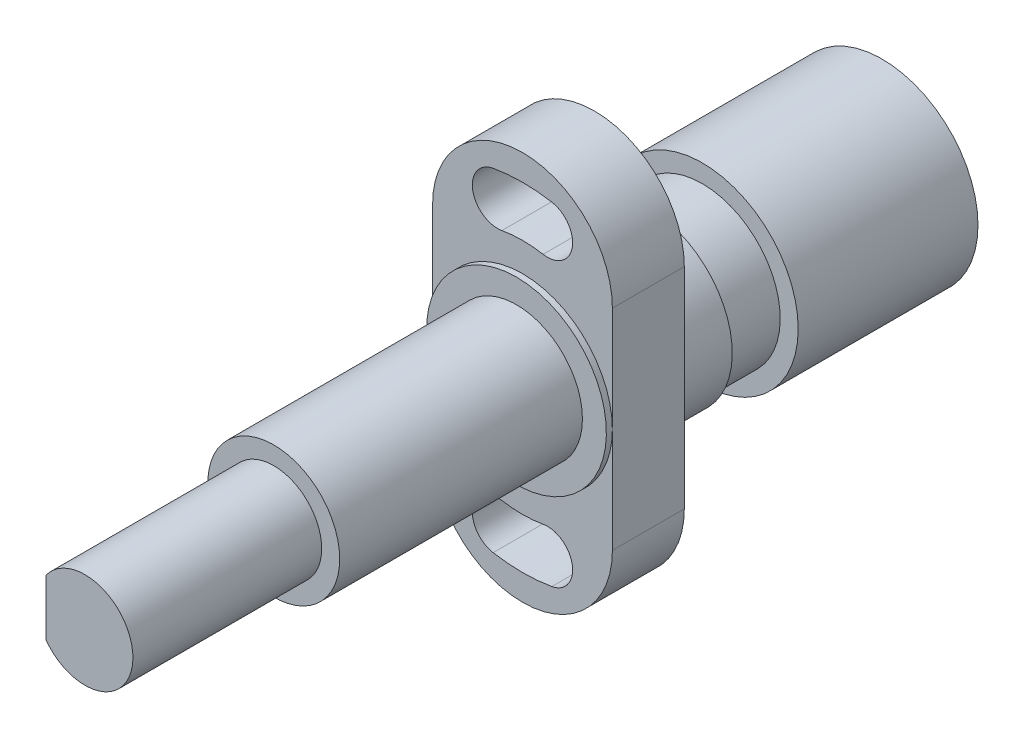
ISO-10303-21;
HEADER;
FILE_DESCRIPTION(('STEP AP214'),'2;1');
FILE_NAME('part.step','',(''),(''),'','','');
FILE_SCHEMA(('AUTOMOTIVE_DESIGN { 1 0 10303 214 1 1 1 1 }'));
ENDSEC;
DATA;
#1=APPLICATION_CONTEXT('core data for automotive mechanical design processes');
#2=APPLICATION_PROTOCOL_DEFINITION('international standard','automotive_design',2000,#1);
#3=PRODUCT_CONTEXT('',#1,'mechanical');
#4=PRODUCT('Part','Part','',(#3));
#5=PRODUCT_RELATED_PRODUCT_CATEGORY('part','',(#4));
#6=PRODUCT_DEFINITION_FORMATION('','',#4);
#7=PRODUCT_DEFINITION_CONTEXT('part definition',#1,'design');
#8=PRODUCT_DEFINITION('design','',#6,#7);
#9=PRODUCT_DEFINITION_SHAPE('','',#8);
#10=(LENGTH_UNIT() NAMED_UNIT(*) SI_UNIT(.MILLI.,.METRE.));
#11=(NAMED_UNIT(*) PLANE_ANGLE_UNIT() SI_UNIT($,.RADIAN.));
#12=(NAMED_UNIT(*) SI_UNIT($,.STERADIAN.) SOLID_ANGLE_UNIT());
#13=UNCERTAINTY_MEASURE_WITH_UNIT(LENGTH_MEASURE(1.E-05),#10,'distance_accuracy_value','');
#14=(GEOMETRIC_REPRESENTATION_CONTEXT(3) GLOBAL_UNCERTAINTY_ASSIGNED_CONTEXT((#13)) GLOBAL_UNIT_ASSIGNED_CONTEXT((#10,
#11,#12)) REPRESENTATION_CONTEXT('',''));
#15=CARTESIAN_POINT('',(0.,0.,0.));
#16=DIRECTION('',(0.,0.,1.));
#17=DIRECTION('',(1.,0.,0.));
#18=AXIS2_PLACEMENT_3D('',#15,#16,#17);
#19=CARTESIAN_POINT('',(-10.,0.,-48.));
#20=DIRECTION('',(0.,0.,1.));
#21=DIRECTION('',(0.,1.,0.));
#22=AXIS2_PLACEMENT_3D('',#19,#20,#21);
#23=PLANE('',#22);
#24=CARTESIAN_POINT('',(0.,0.,-48.));
#25=DIRECTION('',(0.,0.,1.));
#26=DIRECTION('',(1.,0.,0.));
#27=AXIS2_PLACEMENT_3D('',#24,#25,#26);
#28=CIRCLE('',#27,13.15);
#29=CARTESIAN_POINT('',(13.15,0.,-48.));
#30=VERTEX_POINT('',#29);
#31=EDGE_CURVE('E9',#30,#30,#28,.F.);
#32=ORIENTED_EDGE('',*,*,#31,.F.);
#33=EDGE_LOOP('',(#32));
#34=FACE_BOUND('',#33,.T.);
#35=CARTESIAN_POINT('',(0.,0.,-48.));
#36=DIRECTION('',(0.,0.,1.));
#37=DIRECTION('',(1.,0.,0.));
#38=AXIS2_PLACEMENT_3D('',#35,#36,#37);
#39=CIRCLE('',#38,16.);
#40=CARTESIAN_POINT('',(16.,0.,-48.));
#41=VERTEX_POINT('',#40);
#42=EDGE_CURVE('E348',#41,#41,#39,.T.);
#43=ORIENTED_EDGE('',*,*,#42,.F.);
#44=EDGE_LOOP('',(#43));
#45=FACE_BOUND('',#44,.T.);
#46=ADVANCED_FACE('F15',(#34,#45),#23,.F.);
#47=CARTESIAN_POINT('',(0.,0.,-1.));
#48=DIRECTION('',(0.,0.,1.));
#49=DIRECTION('',(0.999988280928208,-0.00484128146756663,0.));
#50=AXIS2_PLACEMENT_3D('',#47,#48,#49);
#51=CYLINDRICAL_SURFACE('',#50,10.);
#52=CARTESIAN_POINT('',(0.,0.,-49.5));
#53=DIRECTION('',(0.,0.,1.));
#54=DIRECTION('',(0.999988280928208,-0.00484128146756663,0.));
#55=AXIS2_PLACEMENT_3D('',#52,#53,#54);
#56=CIRCLE('',#55,10.);
#57=CARTESIAN_POINT('',(9.99988280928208,-0.0484128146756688,-49.5));
#58=VERTEX_POINT('',#57);
#59=EDGE_CURVE('E365',#58,#58,#56,.T.);
#60=ORIENTED_EDGE('',*,*,#59,.F.);
#61=EDGE_LOOP('',(#60));
#62=FACE_BOUND('',#61,.T.);
#63=CARTESIAN_POINT('',(0.,0.,-51.));
#64=DIRECTION('',(0.,0.,1.));
#65=DIRECTION('',(1.,0.,0.));
#66=AXIS2_PLACEMENT_3D('',#63,#64,#65);
#67=CIRCLE('',#66,10.);
#68=CARTESIAN_POINT('',(10.,0.,-51.));
#69=VERTEX_POINT('',#68);
#70=EDGE_CURVE('E352',#69,#69,#67,.T.);
#71=ORIENTED_EDGE('',*,*,#70,.T.);
#72=EDGE_LOOP('',(#71));
#73=FACE_BOUND('',#72,.T.);
#74=ADVANCED_FACE('F447',(#62,#73),#51,.T.);
#75=CARTESIAN_POINT('',(0.,0.,-49.5));
#76=DIRECTION('',(0.,0.,-1.));
#77=DIRECTION('',(-1.,0.,0.));
#78=AXIS2_PLACEMENT_3D('',#75,#76,#77);
#79=PLANE('',#78);
#80=CARTESIAN_POINT('',(0.,0.,-49.5));
#81=DIRECTION('',(0.,0.,-1.));
#82=DIRECTION('',(-1.,0.,0.));
#83=AXIS2_PLACEMENT_3D('',#80,#81,#82);
#84=CIRCLE('',#83,13.15);
#85=CARTESIAN_POINT('',(-13.15,0.,-49.5));
#86=VERTEX_POINT('',#85);
#87=EDGE_CURVE('E360',#86,#86,#84,.T.);
#88=ORIENTED_EDGE('',*,*,#87,.T.);
#89=EDGE_LOOP('',(#88));
#90=FACE_BOUND('',#89,.T.);
#91=ORIENTED_EDGE('',*,*,#59,.T.);
#92=EDGE_LOOP('',(#91));
#93=FACE_BOUND('',#92,.T.);
#94=ADVANCED_FACE('F450',(#90,#93),#79,.T.);
#95=CARTESIAN_POINT('',(0.,0.,-49.5));
#96=DIRECTION('',(0.,0.,1.));
#97=DIRECTION('',(1.,0.,0.));
#98=AXIS2_PLACEMENT_3D('',#95,#96,#97);
#99=CYLINDRICAL_SURFACE('',#98,13.15);
#100=ORIENTED_EDGE('',*,*,#87,.F.);
#101=EDGE_LOOP('',(#100));
#102=FACE_BOUND('',#101,.T.);
#103=ORIENTED_EDGE('',*,*,#31,.T.);
#104=EDGE_LOOP('',(#103));
#105=FACE_BOUND('',#104,.T.);
#106=ADVANCED_FACE('F464',(#102,#105),#99,.T.);
#107=CARTESIAN_POINT('',(9.7,0.,-51.));
#108=DIRECTION('',(0.,0.,-1.));
#109=DIRECTION('',(-1.,0.,0.));
#110=AXIS2_PLACEMENT_3D('',#107,#108,#109);
#111=PLANE('',#110);
#112=CARTESIAN_POINT('',(0.,0.,-51.));
#113=DIRECTION('',(0.,0.,1.));
#114=DIRECTION('',(0.999988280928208,-0.00484128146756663,0.));
#115=AXIS2_PLACEMENT_3D('',#112,#113,#114);
#116=CIRCLE('',#115,9.7);
#117=CARTESIAN_POINT('',(9.69988632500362,-0.0469604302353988,-51.));
#118=VERTEX_POINT('',#117);
#119=EDGE_CURVE('E369',#118,#118,#116,.T.);
#120=ORIENTED_EDGE('',*,*,#119,.T.);
#121=EDGE_LOOP('',(#120));
#122=FACE_BOUND('',#121,.T.);
#123=ORIENTED_EDGE('',*,*,#70,.F.);
#124=EDGE_LOOP('',(#123));
#125=FACE_BOUND('',#124,.T.);
#126=ADVANCED_FACE('F459',(#122,#125),#111,.T.);
#127=CARTESIAN_POINT('',(0.,0.,-52.));
#128=DIRECTION('',(0.,0.,-1.));
#129=DIRECTION('',(-0.999988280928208,0.00484128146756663,0.));
#130=AXIS2_PLACEMENT_3D('',#127,#128,#129);
#131=CONICAL_SURFACE('',#130,2.9,0.785398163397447);
#132=CARTESIAN_POINT('',(0.,0.,-51.6));
#133=DIRECTION('',(0.,0.,-1.));
#134=DIRECTION('',(-1.,0.,0.));
#135=AXIS2_PLACEMENT_3D('',#132,#133,#134);
#136=CIRCLE('',#135,2.5);
#137=CARTESIAN_POINT('',(-2.5,0.,-51.6));
#138=VERTEX_POINT('',#137);
#139=EDGE_CURVE('E312',#138,#138,#136,.F.);
#140=ORIENTED_EDGE('',*,*,#139,.T.);
#141=EDGE_LOOP('',(#140));
#142=FACE_BOUND('',#141,.T.);
#143=CARTESIAN_POINT('',(0.,0.,-52.));
#144=DIRECTION('',(0.,0.,-1.));
#145=DIRECTION('',(-0.999988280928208,0.00484128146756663,0.));
#146=AXIS2_PLACEMENT_3D('',#143,#144,#145);
#147=CIRCLE('',#146,2.9);
#148=CARTESIAN_POINT('',(-2.8999660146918,0.0140397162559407,-52.));
#149=VERTEX_POINT('',#148);
#150=EDGE_CURVE('E25',#149,#149,#147,.T.);
#151=ORIENTED_EDGE('',*,*,#150,.T.);
#152=EDGE_LOOP('',(#151));
#153=FACE_BOUND('',#152,.T.);
#154=ADVANCED_FACE('F455',(#142,#153),#131,.F.);
#155=CARTESIAN_POINT('',(-9.99988280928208,0.0484128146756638,-52.));
#156=DIRECTION('',(0.,0.,1.));
#157=DIRECTION('',(0.999988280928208,-0.00484128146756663,0.));
#158=AXIS2_PLACEMENT_3D('',#155,#156,#157);
#159=PLANE('',#158);
#160=ORIENTED_EDGE('',*,*,#150,.F.);
#161=EDGE_LOOP('',(#160));
#162=FACE_BOUND('',#161,.T.);
#163=CARTESIAN_POINT('',(0.,0.,-52.));
#164=DIRECTION('',(0.,0.,1.));
#165=DIRECTION('',(1.,0.,0.));
#166=AXIS2_PLACEMENT_3D('',#163,#164,#165);
#167=CIRCLE('',#166,9.7);
#168=CARTESIAN_POINT('',(9.7,0.,-52.));
#169=VERTEX_POINT('',#168);
#170=EDGE_CURVE('E356',#169,#169,#167,.T.);
#171=ORIENTED_EDGE('',*,*,#170,.F.);
#172=EDGE_LOOP('',(#171));
#173=FACE_BOUND('',#172,.T.);
#174=ADVANCED_FACE('F452',(#162,#173),#159,.F.);
#175=CARTESIAN_POINT('',(0.,0.,-1.));
#176=DIRECTION('',(0.,0.,1.));
#177=DIRECTION('',(0.999988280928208,-0.00484128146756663,0.));
#178=AXIS2_PLACEMENT_3D('',#175,#176,#177);
#179=CYLINDRICAL_SURFACE('',#178,9.7);
#180=ORIENTED_EDGE('',*,*,#119,.F.);
#181=EDGE_LOOP('',(#180));
#182=FACE_BOUND('',#181,.T.);
#183=ORIENTED_EDGE('',*,*,#170,.T.);
#184=EDGE_LOOP('',(#183));
#185=FACE_BOUND('',#184,.T.);
#186=ADVANCED_FACE('F433',(#182,#185),#179,.T.);
#187=CARTESIAN_POINT('',(-15.,0.,-39.));
#188=DIRECTION('',(-1.,0.,0.));
#189=DIRECTION('',(0.,-1.,0.));
#190=AXIS2_PLACEMENT_3D('',#187,#188,#189);
#191=CONICAL_SURFACE('',#190,2.9,0.785398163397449);
#192=CARTESIAN_POINT('',(-14.6,0.,-39.));
#193=DIRECTION('',(-1.,0.,0.));
#194=DIRECTION('',(0.,1.,0.));
#195=AXIS2_PLACEMENT_3D('',#192,#193,#194);
#196=CIRCLE('',#195,2.5);
#197=CARTESIAN_POINT('',(-14.6,2.5,-39.));
#198=VERTEX_POINT('',#197);
#199=EDGE_CURVE('E316',#198,#198,#196,.F.);
#200=ORIENTED_EDGE('',*,*,#199,.T.);
#201=EDGE_LOOP('',(#200));
#202=FACE_BOUND('',#201,.T.);
#203=CARTESIAN_POINT('',(-15.,0.,-39.));
#204=DIRECTION('',(-1.,0.,0.));
#205=DIRECTION('',(0.,-1.,0.));
#206=AXIS2_PLACEMENT_3D('',#203,#204,#205);
#207=CIRCLE('',#206,2.9);
#208=CARTESIAN_POINT('',(-15.,-2.9,-39.));
#209=VERTEX_POINT('',#208);
#210=EDGE_CURVE('E384',#209,#209,#207,.T.);
#211=ORIENTED_EDGE('',*,*,#210,.T.);
#212=EDGE_LOOP('',(#211));
#213=FACE_BOUND('',#212,.T.);
#214=ADVANCED_FACE('F430',(#202,#213),#191,.F.);
#215=CARTESIAN_POINT('',(-15.,0.,-25.));
#216=DIRECTION('',(-1.,0.,0.));
#217=DIRECTION('',(0.,-1.,0.));
#218=AXIS2_PLACEMENT_3D('',#215,#216,#217);
#219=CONICAL_SURFACE('',#218,2.9,0.785398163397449);
#220=CARTESIAN_POINT('',(-14.6,0.,-25.));
#221=DIRECTION('',(-1.,0.,0.));
#222=DIRECTION('',(0.,1.,0.));
#223=AXIS2_PLACEMENT_3D('',#220,#221,#222);
#224=CIRCLE('',#223,2.5);
#225=CARTESIAN_POINT('',(-14.6,2.5,-25.));
#226=VERTEX_POINT('',#225);
#227=EDGE_CURVE('E19',#226,#226,#224,.F.);
#228=ORIENTED_EDGE('',*,*,#227,.T.);
#229=EDGE_LOOP('',(#228));
#230=FACE_BOUND('',#229,.T.);
#231=CARTESIAN_POINT('',(-15.,0.,-25.));
#232=DIRECTION('',(-1.,0.,0.));
#233=DIRECTION('',(0.,-1.,0.));
#234=AXIS2_PLACEMENT_3D('',#231,#232,#233);
#235=CIRCLE('',#234,2.9);
#236=CARTESIAN_POINT('',(-15.,-2.9,-25.));
#237=VERTEX_POINT('',#236);
#238=EDGE_CURVE('E380',#237,#237,#235,.T.);
#239=ORIENTED_EDGE('',*,*,#238,.T.);
#240=EDGE_LOOP('',(#239));
#241=FACE_BOUND('',#240,.T.);
#242=ADVANCED_FACE('F428',(#230,#241),#219,.F.);
#243=CARTESIAN_POINT('',(-15.,0.,-39.));
#244=DIRECTION('',(-1.,0.,0.));
#245=DIRECTION('',(0.,-1.,0.));
#246=AXIS2_PLACEMENT_3D('',#243,#244,#245);
#247=PLANE('',#246);
#248=ORIENTED_EDGE('',*,*,#210,.F.);
#249=EDGE_LOOP('',(#248));
#250=FACE_BOUND('',#249,.T.);
#251=CARTESIAN_POINT('',(-15.,0.,-39.));
#252=DIRECTION('',(-1.,0.,0.));
#253=DIRECTION('',(0.,-1.,0.));
#254=AXIS2_PLACEMENT_3D('',#251,#252,#253);
#255=CIRCLE('',#254,5.);
#256=CARTESIAN_POINT('',(-15.,-5.,-39.));
#257=VERTEX_POINT('',#256);
#258=EDGE_CURVE('E388',#257,#257,#255,.T.);
#259=ORIENTED_EDGE('',*,*,#258,.T.);
#260=EDGE_LOOP('',(#259));
#261=FACE_BOUND('',#260,.T.);
#262=ADVANCED_FACE('F420',(#250,#261),#247,.T.);
#263=CARTESIAN_POINT('',(-15.,0.,-25.));
#264=DIRECTION('',(-1.,0.,0.));
#265=DIRECTION('',(0.,-1.,0.));
#266=AXIS2_PLACEMENT_3D('',#263,#264,#265);
#267=PLANE('',#266);
#268=ORIENTED_EDGE('',*,*,#238,.F.);
#269=EDGE_LOOP('',(#268));
#270=FACE_BOUND('',#269,.T.);
#271=CARTESIAN_POINT('',(-15.,0.,-25.));
#272=DIRECTION('',(-1.,0.,0.));
#273=DIRECTION('',(0.,-1.,0.));
#274=AXIS2_PLACEMENT_3D('',#271,#272,#273);
#275=CIRCLE('',#274,5.);
#276=CARTESIAN_POINT('',(-15.,-5.,-25.));
#277=VERTEX_POINT('',#276);
#278=EDGE_CURVE('E392',#277,#277,#275,.T.);
#279=ORIENTED_EDGE('',*,*,#278,.T.);
#280=EDGE_LOOP('',(#279));
#281=FACE_BOUND('',#280,.T.);
#282=ADVANCED_FACE('F418',(#270,#281),#267,.T.);
#283=CARTESIAN_POINT('',(-15.,0.,-39.));
#284=DIRECTION('',(-1.,0.,0.));
#285=DIRECTION('',(0.,-1.,0.));
#286=AXIS2_PLACEMENT_3D('',#283,#284,#285);
#287=CYLINDRICAL_SURFACE('',#286,5.);
#288=ORIENTED_EDGE('',*,*,#258,.F.);
#289=EDGE_LOOP('',(#288));
#290=FACE_BOUND('',#289,.T.);
#291=CARTESIAN_POINT('',(-15.1986841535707,-5.,-39.));
#292=CARTESIAN_POINT('',(-15.1986858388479,-4.99999815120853,-39.2733881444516));
#293=CARTESIAN_POINT('',(-15.206141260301,-4.97750155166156,-39.5467950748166));
#294=CARTESIAN_POINT('',(-15.2350255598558,-4.88836701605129,-40.0855766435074));
#295=CARTESIAN_POINT('',(-15.2564582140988,-4.82171715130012,-40.3509490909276));
#296=CARTESIAN_POINT('',(-15.3106375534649,-4.64679152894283,-40.865779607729));
#297=CARTESIAN_POINT('',(-15.3433642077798,-4.53858942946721,-41.115264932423));
#298=CARTESIAN_POINT('',(-15.4164162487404,-4.28387656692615,-41.5926107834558));
#299=CARTESIAN_POINT('',(-15.4567429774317,-4.13735903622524,-41.8204674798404));
#300=CARTESIAN_POINT('',(-15.5420051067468,-3.80478428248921,-42.255915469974));
#301=CARTESIAN_POINT('',(-15.5870449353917,-3.61763759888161,-42.462654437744));
#302=CARTESIAN_POINT('',(-15.6757698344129,-3.21144818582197,-42.8423840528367));
#303=CARTESIAN_POINT('',(-15.719454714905,-2.99240101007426,-43.0153699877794));
#304=CARTESIAN_POINT('',(-15.8017421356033,-2.52250364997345,-43.326444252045));
#305=CARTESIAN_POINT('',(-15.8402073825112,-2.27104622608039,-43.4636548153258));
#306=CARTESIAN_POINT('',(-15.9065020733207,-1.74721693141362,-43.6935041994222));
#307=CARTESIAN_POINT('',(-15.9343340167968,-1.47484999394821,-43.7861534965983));
#308=CARTESIAN_POINT('',(-15.9754870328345,-0.925857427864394,-43.9214045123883));
#309=CARTESIAN_POINT('',(-15.9892295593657,-0.649622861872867,-43.9654629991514));
#310=CARTESIAN_POINT('',(-16.0021438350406,-0.0933632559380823,-44.0068973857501));
#311=CARTESIAN_POINT('',(-16.0013188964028,0.186660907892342,-44.0042838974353));
#312=CARTESIAN_POINT('',(-15.9854846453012,0.732297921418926,-43.9534068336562));
#313=CARTESIAN_POINT('',(-15.9709660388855,0.998074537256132,-43.906722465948));
#314=CARTESIAN_POINT('',(-15.929979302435,1.51781225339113,-43.7716200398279));
#315=CARTESIAN_POINT('',(-15.9035103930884,1.77177258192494,-43.6831992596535));
#316=CARTESIAN_POINT('',(-15.8409383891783,2.26431241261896,-43.4661192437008));
#317=CARTESIAN_POINT('',(-15.8047213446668,2.5026656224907,-43.336980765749));
#318=CARTESIAN_POINT('',(-15.7264689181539,2.95481004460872,-43.0425156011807));
#319=CARTESIAN_POINT('',(-15.6844320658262,3.16859502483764,-42.8771797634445));
#320=CARTESIAN_POINT('',(-15.5969468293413,3.57495079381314,-42.5069054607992));
#321=CARTESIAN_POINT('',(-15.5514292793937,3.76626619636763,-42.3006037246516));
#322=CARTESIAN_POINT('',(-15.4636246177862,4.11195897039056,-41.8584195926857));
#323=CARTESIAN_POINT('',(-15.4213378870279,4.26633199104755,-41.6225337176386));
#324=CARTESIAN_POINT('',(-15.3444338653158,4.53521860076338,-41.1243301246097));
#325=CARTESIAN_POINT('',(-15.3099076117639,4.64926722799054,-40.8617463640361));
#326=CARTESIAN_POINT('',(-15.253501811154,4.83113383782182,-40.319762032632));
#327=CARTESIAN_POINT('',(-15.2316177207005,4.89896843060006,-40.0403675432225));
#328=CARTESIAN_POINT('',(-15.2039825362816,4.9840594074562,-39.4847201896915));
#329=CARTESIAN_POINT('',(-15.1976186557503,5.00323817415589,-39.2087920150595));
#330=CARTESIAN_POINT('',(-15.200043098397,4.99586977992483,-38.6576410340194));
#331=CARTESIAN_POINT('',(-15.2088290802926,4.96932968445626,-38.3824181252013));
#332=CARTESIAN_POINT('',(-15.2399582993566,4.87299494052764,-37.8487668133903));
#333=CARTESIAN_POINT('',(-15.2619021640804,4.80447324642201,-37.5900829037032));
#334=CARTESIAN_POINT('',(-15.3164514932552,4.62761494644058,-37.0879128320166));
#335=CARTESIAN_POINT('',(-15.3490586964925,4.51927184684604,-36.8444291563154));
#336=CARTESIAN_POINT('',(-15.4224215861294,4.26230042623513,-36.3718435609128));
#337=CARTESIAN_POINT('',(-15.4633841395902,4.11260589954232,-36.1433543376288));
#338=CARTESIAN_POINT('',(-15.5484139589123,3.7784256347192,-35.7140386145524));
#339=CARTESIAN_POINT('',(-15.5924820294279,3.59393085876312,-35.5132193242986));
#340=CARTESIAN_POINT('',(-15.6809675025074,3.18629179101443,-35.1363585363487));
#341=CARTESIAN_POINT('',(-15.7253236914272,2.96186259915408,-34.9616888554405));
#342=CARTESIAN_POINT('',(-15.8075623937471,2.48580618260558,-34.652435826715));
#343=CARTESIAN_POINT('',(-15.8454452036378,2.23418020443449,-34.5178506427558));
#344=CARTESIAN_POINT('',(-15.9102524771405,1.71242209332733,-34.2938777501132));
#345=CARTESIAN_POINT('',(-15.937255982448,1.44244073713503,-34.2041628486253));
#346=CARTESIAN_POINT('',(-15.9776097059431,0.890229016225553,-34.0717098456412));
#347=CARTESIAN_POINT('',(-15.9909641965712,0.608002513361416,-34.028957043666));
#348=CARTESIAN_POINT('',(-16.0022321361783,0.0519397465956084,-33.9928359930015));
#349=CARTESIAN_POINT('',(-16.0007651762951,-0.221756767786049,-33.9974861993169));
#350=CARTESIAN_POINT('',(-15.9840391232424,-0.764292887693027,-34.0512472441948));
#351=CARTESIAN_POINT('',(-15.9687809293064,-1.03313280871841,-34.100355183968));
#352=CARTESIAN_POINT('',(-15.9263828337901,-1.55502047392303,-34.2403760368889));
#353=CARTESIAN_POINT('',(-15.899393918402,-1.80822367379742,-34.3307584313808));
#354=CARTESIAN_POINT('',(-15.8363178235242,-2.29599370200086,-34.5502833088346));
#355=CARTESIAN_POINT('',(-15.8002290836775,-2.53055732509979,-34.6794324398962));
#356=CARTESIAN_POINT('',(-15.7211958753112,-2.98304677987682,-34.9778910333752));
#357=CARTESIAN_POINT('',(-15.6780603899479,-3.20013842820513,-35.148414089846));
#358=CARTESIAN_POINT('',(-15.590349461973,-3.60328316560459,-35.5226395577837));
#359=CARTESIAN_POINT('',(-15.5457735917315,-3.78932693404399,-35.7263518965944));
#360=CARTESIAN_POINT('',(-15.4584757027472,-4.13131463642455,-36.1692628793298));
#361=CARTESIAN_POINT('',(-15.4158640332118,-4.28605711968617,-36.4094136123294));
#362=CARTESIAN_POINT('',(-15.3392050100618,-4.5528188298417,-36.9135924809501));
#363=CARTESIAN_POINT('',(-15.3051541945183,-4.66485533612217,-37.1776109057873));
#364=CARTESIAN_POINT('',(-15.2522624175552,-4.83484721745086,-37.6988904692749));
#365=CARTESIAN_POINT('',(-15.2323726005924,-4.89659759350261,-37.9548101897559));
#366=CARTESIAN_POINT('',(-15.2055842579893,-4.97916983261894,-38.4738153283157));
#367=CARTESIAN_POINT('',(-15.1986825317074,-5.00000177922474,-38.7368989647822));
#368=CARTESIAN_POINT('',(-15.1986841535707,-5.,-39.));
#369=B_SPLINE_CURVE_WITH_KNOTS('',3,(#291,#292,#293,#294,#295,#296,#297,#298,#299,#300,#301,
#302,#303,#304,#305,#306,#307,#308,#309,#310,#311,#312,#313,#314,#315,#316,#317,#318,#319,#320,
#321,#322,#323,#324,#325,#326,#327,#328,#329,#330,#331,#332,#333,#334,#335,#336,#337,#338,#339,
#340,#341,#342,#343,#344,#345,#346,#347,#348,#349,#350,#351,#352,#353,#354,#355,#356,#357,#358,
#359,#360,#361,#362,#363,#364,#365,#366,#367,#368),.UNSPECIFIED.,.T.,.F.,(4,2,2,2,2,2,2,2,2,2,2,
2,2,2,2,2,2,2,2,2,2,2,2,2,2,2,2,2,2,2,2,2,2,2,2,2,2,2,4),(0.,0.819192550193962,1.63860650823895,
2.45657457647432,3.27468721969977,4.11828322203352,4.96199691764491,5.82479287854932,
6.68738589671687,7.52334891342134,8.35912185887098,9.16603931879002,9.97300940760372,
10.7898561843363,11.6069097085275,12.4580135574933,13.309217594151,14.1699388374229,
15.0303505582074,15.8561973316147,16.6819164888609,17.4837588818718,18.2857320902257,
19.1107045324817,19.9358915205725,20.7952775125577,21.6546241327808,22.5076095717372,
23.3603279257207,24.1775520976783,24.9947229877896,25.8016738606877,26.6087631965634,
27.4432277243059,28.2779423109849,29.1403118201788,30.002332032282,30.7908941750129,
31.5792619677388),.UNSPECIFIED.);
#370=CARTESIAN_POINT('',(-15.1986841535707,-5.,-39.));
#371=VERTEX_POINT('',#370);
#372=EDGE_CURVE('E370',#371,#371,#369,.T.);
#373=ORIENTED_EDGE('',*,*,#372,.F.);
#374=EDGE_LOOP('',(#373));
#375=FACE_BOUND('',#374,.T.);
#376=ADVANCED_FACE('F416',(#290,#375),#287,.F.);
#377=CARTESIAN_POINT('',(-15.,0.,-25.));
#378=DIRECTION('',(-1.,0.,0.));
#379=DIRECTION('',(0.,-1.,0.));
#380=AXIS2_PLACEMENT_3D('',#377,#378,#379);
#381=CYLINDRICAL_SURFACE('',#380,5.);
#382=ORIENTED_EDGE('',*,*,#278,.F.);
#383=EDGE_LOOP('',(#382));
#384=FACE_BOUND('',#383,.T.);
#385=CARTESIAN_POINT('',(-15.1986841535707,-5.,-25.));
#386=CARTESIAN_POINT('',(-15.1986858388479,-4.99999815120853,-25.2733881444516));
#387=CARTESIAN_POINT('',(-15.206141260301,-4.97750155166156,-25.5467950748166));
#388=CARTESIAN_POINT('',(-15.2350255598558,-4.88836701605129,-26.0855766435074));
#389=CARTESIAN_POINT('',(-15.2564582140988,-4.82171715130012,-26.3509490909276));
#390=CARTESIAN_POINT('',(-15.3106375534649,-4.64679152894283,-26.865779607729));
#391=CARTESIAN_POINT('',(-15.3433642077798,-4.53858942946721,-27.115264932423));
#392=CARTESIAN_POINT('',(-15.4164162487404,-4.28387656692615,-27.5926107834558));
#393=CARTESIAN_POINT('',(-15.4567429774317,-4.13735903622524,-27.8204674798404));
#394=CARTESIAN_POINT('',(-15.5420051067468,-3.80478428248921,-28.255915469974));
#395=CARTESIAN_POINT('',(-15.5870449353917,-3.61763759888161,-28.462654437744));
#396=CARTESIAN_POINT('',(-15.6757698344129,-3.21144818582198,-28.8423840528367));
#397=CARTESIAN_POINT('',(-15.719454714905,-2.99240101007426,-29.0153699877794));
#398=CARTESIAN_POINT('',(-15.8017421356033,-2.52250364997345,-29.326444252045));
#399=CARTESIAN_POINT('',(-15.8402073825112,-2.27104622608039,-29.4636548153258));
#400=CARTESIAN_POINT('',(-15.9065020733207,-1.74721693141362,-29.6935041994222));
#401=CARTESIAN_POINT('',(-15.9343340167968,-1.47484999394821,-29.7861534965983));
#402=CARTESIAN_POINT('',(-15.9754870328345,-0.92585742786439,-29.9214045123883));
#403=CARTESIAN_POINT('',(-15.9892295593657,-0.649622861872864,-29.9654629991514));
#404=CARTESIAN_POINT('',(-16.0021438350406,-0.0933632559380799,-30.0068973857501));
#405=CARTESIAN_POINT('',(-16.0013188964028,0.186660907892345,-30.0042838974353));
#406=CARTESIAN_POINT('',(-15.9854846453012,0.732297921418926,-29.9534068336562));
#407=CARTESIAN_POINT('',(-15.9709660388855,0.998074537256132,-29.906722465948));
#408=CARTESIAN_POINT('',(-15.929979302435,1.51781225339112,-29.7716200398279));
#409=CARTESIAN_POINT('',(-15.9035103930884,1.77177258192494,-29.6831992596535));
#410=CARTESIAN_POINT('',(-15.8409383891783,2.26431241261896,-29.4661192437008));
#411=CARTESIAN_POINT('',(-15.8047213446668,2.5026656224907,-29.336980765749));
#412=CARTESIAN_POINT('',(-15.7264689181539,2.95481004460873,-29.0425156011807));
#413=CARTESIAN_POINT('',(-15.6844320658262,3.16859502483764,-28.8771797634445));
#414=CARTESIAN_POINT('',(-15.5969468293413,3.57495079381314,-28.5069054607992));
#415=CARTESIAN_POINT('',(-15.5514292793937,3.76626619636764,-28.3006037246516));
#416=CARTESIAN_POINT('',(-15.4636246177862,4.11195897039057,-27.8584195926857));
#417=CARTESIAN_POINT('',(-15.4213378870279,4.26633199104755,-27.6225337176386));
#418=CARTESIAN_POINT('',(-15.3444338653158,4.53521860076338,-27.1243301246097));
#419=CARTESIAN_POINT('',(-15.3099076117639,4.64926722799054,-26.8617463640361));
#420=CARTESIAN_POINT('',(-15.253501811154,4.83113383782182,-26.319762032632));
#421=CARTESIAN_POINT('',(-15.2316177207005,4.89896843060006,-26.0403675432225));
#422=CARTESIAN_POINT('',(-15.2039825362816,4.9840594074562,-25.4847201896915));
#423=CARTESIAN_POINT('',(-15.1976186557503,5.00323817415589,-25.2087920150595));
#424=CARTESIAN_POINT('',(-15.200043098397,4.99586977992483,-24.6576410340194));
#425=CARTESIAN_POINT('',(-15.2088290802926,4.96932968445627,-24.3824181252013));
#426=CARTESIAN_POINT('',(-15.2399582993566,4.87299494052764,-23.8487668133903));
#427=CARTESIAN_POINT('',(-15.2619021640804,4.80447324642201,-23.5900829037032));
#428=CARTESIAN_POINT('',(-15.3164514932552,4.62761494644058,-23.0879128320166));
#429=CARTESIAN_POINT('',(-15.3490586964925,4.51927184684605,-22.8444291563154));
#430=CARTESIAN_POINT('',(-15.4224215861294,4.26230042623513,-22.3718435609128));
#431=CARTESIAN_POINT('',(-15.4633841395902,4.11260589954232,-22.1433543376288));
#432=CARTESIAN_POINT('',(-15.5484139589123,3.7784256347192,-21.7140386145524));
#433=CARTESIAN_POINT('',(-15.5924820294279,3.59393085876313,-21.5132193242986));
#434=CARTESIAN_POINT('',(-15.6809675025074,3.18629179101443,-21.1363585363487));
#435=CARTESIAN_POINT('',(-15.7253236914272,2.96186259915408,-20.9616888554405));
#436=CARTESIAN_POINT('',(-15.8075623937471,2.48580618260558,-20.652435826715));
#437=CARTESIAN_POINT('',(-15.8454452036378,2.23418020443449,-20.5178506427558));
#438=CARTESIAN_POINT('',(-15.9102524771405,1.71242209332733,-20.2938777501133));
#439=CARTESIAN_POINT('',(-15.937255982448,1.44244073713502,-20.2041628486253));
#440=CARTESIAN_POINT('',(-15.9776097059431,0.89022901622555,-20.0717098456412));
#441=CARTESIAN_POINT('',(-15.9909641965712,0.608002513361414,-20.028957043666));
#442=CARTESIAN_POINT('',(-16.0022321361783,0.0519397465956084,-19.9928359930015));
#443=CARTESIAN_POINT('',(-16.0007651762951,-0.221756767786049,-19.9974861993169));
#444=CARTESIAN_POINT('',(-15.9840391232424,-0.764292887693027,-20.0512472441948));
#445=CARTESIAN_POINT('',(-15.9687809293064,-1.03313280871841,-20.100355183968));
#446=CARTESIAN_POINT('',(-15.9263828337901,-1.55502047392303,-20.2403760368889));
#447=CARTESIAN_POINT('',(-15.899393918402,-1.80822367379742,-20.3307584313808));
#448=CARTESIAN_POINT('',(-15.8363178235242,-2.29599370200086,-20.5502833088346));
#449=CARTESIAN_POINT('',(-15.8002290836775,-2.53055732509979,-20.6794324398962));
#450=CARTESIAN_POINT('',(-15.7211958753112,-2.98304677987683,-20.9778910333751));
#451=CARTESIAN_POINT('',(-15.6780603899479,-3.20013842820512,-21.148414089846));
#452=CARTESIAN_POINT('',(-15.590349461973,-3.60328316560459,-21.5226395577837));
#453=CARTESIAN_POINT('',(-15.5457735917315,-3.78932693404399,-21.7263518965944));
#454=CARTESIAN_POINT('',(-15.4584757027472,-4.13131463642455,-22.1692628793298));
#455=CARTESIAN_POINT('',(-15.4158640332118,-4.28605711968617,-22.4094136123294));
#456=CARTESIAN_POINT('',(-15.3392050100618,-4.5528188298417,-22.9135924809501));
#457=CARTESIAN_POINT('',(-15.3051541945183,-4.66485533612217,-23.1776109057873));
#458=CARTESIAN_POINT('',(-15.2522624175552,-4.83484721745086,-23.6988904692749));
#459=CARTESIAN_POINT('',(-15.2323726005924,-4.89659759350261,-23.9548101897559));
#460=CARTESIAN_POINT('',(-15.2055842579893,-4.97916983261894,-24.4738153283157));
#461=CARTESIAN_POINT('',(-15.1986825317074,-5.00000177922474,-24.7368989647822));
#462=CARTESIAN_POINT('',(-15.1986841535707,-5.,-25.));
#463=B_SPLINE_CURVE_WITH_KNOTS('',3,(#385,#386,#387,#388,#389,#390,#391,#392,#393,#394,#395,
#396,#397,#398,#399,#400,#401,#402,#403,#404,#405,#406,#407,#408,#409,#410,#411,#412,#413,#414,
#415,#416,#417,#418,#419,#420,#421,#422,#423,#424,#425,#426,#427,#428,#429,#430,#431,#432,#433,
#434,#435,#436,#437,#438,#439,#440,#441,#442,#443,#444,#445,#446,#447,#448,#449,#450,#451,#452,
#453,#454,#455,#456,#457,#458,#459,#460,#461,#462),.UNSPECIFIED.,.T.,.F.,(4,2,2,2,2,2,2,2,2,2,2,
2,2,2,2,2,2,2,2,2,2,2,2,2,2,2,2,2,2,2,2,2,2,2,2,2,2,2,4),(0.,0.819192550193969,1.63860650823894,
2.45657457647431,3.27468721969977,4.11828322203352,4.9619969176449,5.82479287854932,
6.68738589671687,7.52334891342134,8.35912185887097,9.16603931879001,9.97300940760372,
10.7898561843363,11.6069097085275,12.4580135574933,13.309217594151,14.1699388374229,
15.0303505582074,15.8561973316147,16.6819164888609,17.4837588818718,18.2857320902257,
19.1107045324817,19.9358915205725,20.7952775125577,21.6546241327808,22.5076095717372,
23.3603279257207,24.1775520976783,24.9947229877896,25.8016738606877,26.6087631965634,
27.4432277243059,28.2779423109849,29.1403118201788,30.002332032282,30.7908941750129,
31.5792619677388),.UNSPECIFIED.);
#464=CARTESIAN_POINT('',(-15.1986841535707,-5.,-25.));
#465=VERTEX_POINT('',#464);
#466=EDGE_CURVE('E396',#465,#465,#463,.T.);
#467=ORIENTED_EDGE('',*,*,#466,.F.);
#468=EDGE_LOOP('',(#467));
#469=FACE_BOUND('',#468,.T.);
#470=ADVANCED_FACE('F412',(#384,#469),#381,.F.);
#471=CARTESIAN_POINT('',(0.,0.,-9.));
#472=DIRECTION('',(0.,0.,1.));
#473=DIRECTION('',(0.,1.,0.));
#474=AXIS2_PLACEMENT_3D('',#471,#472,#473);
#475=CYLINDRICAL_SURFACE('',#474,16.);
#476=ORIENTED_EDGE('',*,*,#466,.T.);
#477=EDGE_LOOP('',(#476));
#478=FACE_BOUND('',#477,.T.);
#479=ORIENTED_EDGE('',*,*,#372,.T.);
#480=EDGE_LOOP('',(#479));
#481=FACE_BOUND('',#480,.T.);
#482=ORIENTED_EDGE('',*,*,#42,.T.);
#483=EDGE_LOOP('',(#482));
#484=FACE_BOUND('',#483,.T.);
#485=CARTESIAN_POINT('',(0.,0.,-18.));
#486=DIRECTION('',(0.,0.,1.));
#487=DIRECTION('',(1.,0.,0.));
#488=AXIS2_PLACEMENT_3D('',#485,#486,#487);
#489=CIRCLE('',#488,16.);
#490=CARTESIAN_POINT('',(16.,0.,-18.));
#491=VERTEX_POINT('',#490);
#492=EDGE_CURVE('E344',#491,#491,#489,.T.);
#493=ORIENTED_EDGE('',*,*,#492,.F.);
#494=EDGE_LOOP('',(#493));
#495=FACE_BOUND('',#494,.T.);
#496=ADVANCED_FACE('F409',(#478,#481,#484,#495),#475,.T.);
#497=CARTESIAN_POINT('',(0.,0.,-9.));
#498=DIRECTION('',(0.,0.,1.));
#499=DIRECTION('',(0.,1.,0.));
#500=AXIS2_PLACEMENT_3D('',#497,#498,#499);
#501=CYLINDRICAL_SURFACE('',#500,13.);
#502=CARTESIAN_POINT('',(0.,0.,-18.));
#503=DIRECTION('',(0.,0.,1.));
#504=DIRECTION('',(0.,1.,0.));
#505=AXIS2_PLACEMENT_3D('',#502,#503,#504);
#506=CIRCLE('',#505,13.);
#507=CARTESIAN_POINT('',(0.,13.,-18.));
#508=VERTEX_POINT('',#507);
#509=EDGE_CURVE('E364',#508,#508,#506,.T.);
#510=ORIENTED_EDGE('',*,*,#509,.T.);
#511=EDGE_LOOP('',(#510));
#512=FACE_BOUND('',#511,.T.);
#513=CARTESIAN_POINT('',(0.,0.,-9.));
#514=DIRECTION('',(0.,0.,1.));
#515=DIRECTION('',(1.,0.,0.));
#516=AXIS2_PLACEMENT_3D('',#513,#514,#515);
#517=CIRCLE('',#516,13.);
#518=CARTESIAN_POINT('',(13.,0.,-9.));
#519=VERTEX_POINT('',#518);
#520=EDGE_CURVE('E288',#519,#519,#517,.T.);
#521=ORIENTED_EDGE('',*,*,#520,.F.);
#522=EDGE_LOOP('',(#521));
#523=FACE_BOUND('',#522,.T.);
#524=ADVANCED_FACE('F441',(#512,#523),#501,.T.);
#525=CARTESIAN_POINT('',(-16.,0.,-18.));
#526=DIRECTION('',(0.,0.,1.));
#527=DIRECTION('',(0.,1.,0.));
#528=AXIS2_PLACEMENT_3D('',#525,#526,#527);
#529=PLANE('',#528);
#530=ORIENTED_EDGE('',*,*,#509,.F.);
#531=EDGE_LOOP('',(#530));
#532=FACE_BOUND('',#531,.T.);
#533=ORIENTED_EDGE('',*,*,#492,.T.);
#534=EDGE_LOOP('',(#533));
#535=FACE_BOUND('',#534,.T.);
#536=ADVANCED_FACE('F437',(#532,#535),#529,.T.);
#537=CARTESIAN_POINT('',(-6.5,0.,81.));
#538=DIRECTION('',(-1.,0.,0.));
#539=DIRECTION('',(0.,1.,0.));
#540=AXIS2_PLACEMENT_3D('',#537,#538,#539);
#541=CONICAL_SURFACE('',#540,2.65,0.785398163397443);
#542=CARTESIAN_POINT('',(-6.35,0.,81.));
#543=DIRECTION('',(-1.,0.,0.));
#544=DIRECTION('',(0.,0.,1.));
#545=AXIS2_PLACEMENT_3D('',#542,#543,#544);
#546=CIRCLE('',#545,2.5);
#547=CARTESIAN_POINT('',(-6.35,0.,83.5));
#548=VERTEX_POINT('',#547);
#549=EDGE_CURVE('E294',#548,#548,#546,.F.);
#550=ORIENTED_EDGE('',*,*,#549,.T.);
#551=EDGE_LOOP('',(#550));
#552=FACE_BOUND('',#551,.T.);
#553=CARTESIAN_POINT('',(-6.5,0.,81.));
#554=DIRECTION('',(1.,0.,0.));
#555=DIRECTION('',(0.,1.,0.));
#556=AXIS2_PLACEMENT_3D('',#553,#554,#555);
#557=CIRCLE('',#556,2.65);
#558=CARTESIAN_POINT('',(-6.5,2.65000000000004,81.));
#559=VERTEX_POINT('',#558);
#560=EDGE_CURVE('E183',#559,#559,#557,.T.);
#561=ORIENTED_EDGE('',*,*,#560,.F.);
#562=EDGE_LOOP('',(#561));
#563=FACE_BOUND('',#562,.T.);
#564=ADVANCED_FACE('F440',(#552,#563),#541,.F.);
#565=CARTESIAN_POINT('',(0.,0.,85.));
#566=DIRECTION('',(0.,0.,1.));
#567=DIRECTION('',(0.,-1.,0.));
#568=AXIS2_PLACEMENT_3D('',#565,#566,#567);
#569=PLANE('',#568);
#570=DIRECTION('',(0.,-1.,0.));
#571=VECTOR('',#570,1.);
#572=CARTESIAN_POINT('',(-6.5,10.,85.));
#573=LINE('',#572,#571);
#574=CARTESIAN_POINT('',(-6.5,4.66368952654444,85.));
#575=VERTEX_POINT('',#574);
#576=CARTESIAN_POINT('',(-6.5,-4.66368952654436,85.));
#577=VERTEX_POINT('',#576);
#578=EDGE_CURVE('E192',#575,#577,#573,.T.);
#579=ORIENTED_EDGE('',*,*,#578,.T.);
#580=CARTESIAN_POINT('',(0.,0.,85.));
#581=DIRECTION('',(0.,0.,-1.));
#582=DIRECTION('',(1.,0.,0.));
#583=AXIS2_PLACEMENT_3D('',#580,#581,#582);
#584=CIRCLE('',#583,8.);
#585=EDGE_CURVE('E1043',#575,#577,#584,.T.);
#586=ORIENTED_EDGE('',*,*,#585,.F.);
#587=EDGE_LOOP('',(#579,#586));
#588=FACE_BOUND('',#587,.T.);
#589=ADVANCED_FACE('F555',(#588),#569,.T.);
#590=CARTESIAN_POINT('',(-6.5,10.,75.));
#591=DIRECTION('',(0.500000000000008,0.,-0.866025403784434));
#592=DIRECTION('',(-0.866025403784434,0.,-0.500000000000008));
#593=AXIS2_PLACEMENT_3D('',#590,#591,#592);
#594=PLANE('',#593);
#595=CARTESIAN_POINT('',(0.,0.,78.7527767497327));
#596=DIRECTION('',(-0.500000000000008,0.,0.866025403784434));
#597=DIRECTION('',(-0.866025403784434,0.,-0.500000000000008));
#598=AXIS2_PLACEMENT_3D('',#595,#596,#597);
#599=ELLIPSE('',#598,9.23760430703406,8.);
#600=CARTESIAN_POINT('',(-6.5,4.66368952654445,75.));
#601=VERTEX_POINT('',#600);
#602=CARTESIAN_POINT('',(-6.5,-4.66368952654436,75.));
#603=VERTEX_POINT('',#602);
#604=EDGE_CURVE('E246',#601,#603,#599,.T.);
#605=ORIENTED_EDGE('',*,*,#604,.T.);
#606=DIRECTION('',(0.,-1.,0.));
#607=VECTOR('',#606,1.);
#608=CARTESIAN_POINT('',(-6.5,10.,75.));
#609=LINE('',#608,#607);
#610=EDGE_CURVE('E191',#601,#603,#609,.T.);
#611=ORIENTED_EDGE('',*,*,#610,.F.);
#612=EDGE_LOOP('',(#605,#611));
#613=FACE_BOUND('',#612,.T.);
#614=ADVANCED_FACE('F557',(#613),#594,.F.);
#615=CARTESIAN_POINT('',(-6.5,10.,85.));
#616=DIRECTION('',(1.,0.,0.));
#617=DIRECTION('',(0.,0.,-1.));
#618=AXIS2_PLACEMENT_3D('',#615,#616,#617);
#619=PLANE('',#618);
#620=ORIENTED_EDGE('',*,*,#578,.F.);
#621=DIRECTION('',(0.,0.,-1.));
#622=VECTOR('',#621,1.);
#623=CARTESIAN_POINT('',(-6.5,4.66368952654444,0.));
#624=LINE('',#623,#622);
#625=EDGE_CURVE('E253',#575,#601,#624,.T.);
#626=ORIENTED_EDGE('',*,*,#625,.T.);
#627=ORIENTED_EDGE('',*,*,#610,.T.);
#628=DIRECTION('',(0.,0.,-1.));
#629=VECTOR('',#628,1.);
#630=CARTESIAN_POINT('',(-6.5,-4.66368952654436,0.));
#631=LINE('',#630,#629);
#632=EDGE_CURVE('E250',#603,#577,#631,.F.);
#633=ORIENTED_EDGE('',*,*,#632,.T.);
#634=EDGE_LOOP('',(#620,#626,#627,#633));
#635=FACE_BOUND('',#634,.T.);
#636=ORIENTED_EDGE('',*,*,#560,.T.);
#637=EDGE_LOOP('',(#636));
#638=FACE_BOUND('',#637,.T.);
#639=ADVANCED_FACE('F567',(#635,#638),#619,.F.);
#640=CARTESIAN_POINT('',(0.,0.,0.));
#641=DIRECTION('',(0.,0.,-1.));
#642=DIRECTION('',(0.,1.,0.));
#643=AXIS2_PLACEMENT_3D('',#640,#641,#642);
#644=CYLINDRICAL_SURFACE('',#643,8.);
#645=ORIENTED_EDGE('',*,*,#632,.F.);
#646=ORIENTED_EDGE('',*,*,#604,.F.);
#647=ORIENTED_EDGE('',*,*,#625,.F.);
#648=ORIENTED_EDGE('',*,*,#585,.T.);
#649=EDGE_LOOP('',(#645,#646,#647,#648));
#650=FACE_BOUND('',#649,.T.);
#651=CARTESIAN_POINT('',(0.,0.,53.5));
#652=DIRECTION('',(0.,0.,1.));
#653=DIRECTION('',(0.,1.,0.));
#654=AXIS2_PLACEMENT_3D('',#651,#652,#653);
#655=CIRCLE('',#654,8.);
#656=CARTESIAN_POINT('',(0.,8.00000000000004,53.5));
#657=VERTEX_POINT('',#656);
#658=EDGE_CURVE('E196',#657,#657,#655,.T.);
#659=ORIENTED_EDGE('',*,*,#658,.T.);
#660=EDGE_LOOP('',(#659));
#661=FACE_BOUND('',#660,.T.);
#662=ADVANCED_FACE('F571',(#650,#661),#644,.T.);
#663=CARTESIAN_POINT('',(-11.,0.,53.5));
#664=DIRECTION('',(0.,0.,-1.));
#665=DIRECTION('',(0.,1.,0.));
#666=AXIS2_PLACEMENT_3D('',#663,#664,#665);
#667=PLANE('',#666);
#668=ORIENTED_EDGE('',*,*,#658,.F.);
#669=EDGE_LOOP('',(#668));
#670=FACE_BOUND('',#669,.T.);
#671=CARTESIAN_POINT('',(0.,0.,53.5));
#672=DIRECTION('',(0.,0.,-1.));
#673=DIRECTION('',(1.,0.,0.));
#674=AXIS2_PLACEMENT_3D('',#671,#672,#673);
#675=CIRCLE('',#674,11.);
#676=CARTESIAN_POINT('',(11.,0.,53.5));
#677=VERTEX_POINT('',#676);
#678=EDGE_CURVE('E1022',#677,#677,#675,.T.);
#679=ORIENTED_EDGE('',*,*,#678,.F.);
#680=EDGE_LOOP('',(#679));
#681=FACE_BOUND('',#680,.T.);
#682=ADVANCED_FACE('F575',(#670,#681),#667,.F.);
#683=CARTESIAN_POINT('',(0.,0.,0.));
#684=DIRECTION('',(0.,0.,-1.));
#685=DIRECTION('',(0.,1.,0.));
#686=AXIS2_PLACEMENT_3D('',#683,#684,#685);
#687=CYLINDRICAL_SURFACE('',#686,11.);
#688=CARTESIAN_POINT('',(0.,0.,13.));
#689=DIRECTION('',(0.,0.,-1.));
#690=DIRECTION('',(0.,-1.,0.));
#691=AXIS2_PLACEMENT_3D('',#688,#689,#690);
#692=CIRCLE('',#691,11.);
#693=CARTESIAN_POINT('',(0.,-11.,13.));
#694=VERTEX_POINT('',#693);
#695=EDGE_CURVE('E242',#694,#694,#692,.F.);
#696=ORIENTED_EDGE('',*,*,#695,.T.);
#697=EDGE_LOOP('',(#696));
#698=FACE_BOUND('',#697,.T.);
#699=ORIENTED_EDGE('',*,*,#678,.T.);
#700=EDGE_LOOP('',(#699));
#701=FACE_BOUND('',#700,.T.);
#702=ADVANCED_FACE('F558',(#698,#701),#687,.T.);
#703=CARTESIAN_POINT('',(-11.,0.,13.));
#704=DIRECTION('',(0.,0.,1.));
#705=DIRECTION('',(0.,-1.,0.));
#706=AXIS2_PLACEMENT_3D('',#703,#704,#705);
#707=PLANE('',#706);
#708=ORIENTED_EDGE('',*,*,#695,.F.);
#709=EDGE_LOOP('',(#708));
#710=FACE_BOUND('',#709,.T.);
#711=CARTESIAN_POINT('',(0.,0.,13.));
#712=DIRECTION('',(0.,0.,1.));
#713=DIRECTION('',(0.,1.,0.));
#714=AXIS2_PLACEMENT_3D('',#711,#712,#713);
#715=CIRCLE('',#714,14.995);
#716=CARTESIAN_POINT('',(0.,14.995,13.));
#717=VERTEX_POINT('',#716);
#718=EDGE_CURVE('E238',#717,#717,#715,.T.);
#719=ORIENTED_EDGE('',*,*,#718,.T.);
#720=EDGE_LOOP('',(#719));
#721=FACE_BOUND('',#720,.T.);
#722=ADVANCED_FACE('F602',(#710,#721),#707,.T.);
#723=CARTESIAN_POINT('',(0.,0.,0.));
#724=DIRECTION('',(0.,0.,-1.));
#725=DIRECTION('',(0.,1.,0.));
#726=AXIS2_PLACEMENT_3D('',#723,#724,#725);
#727=CYLINDRICAL_SURFACE('',#726,14.995);
#728=ORIENTED_EDGE('',*,*,#718,.F.);
#729=EDGE_LOOP('',(#728));
#730=FACE_BOUND('',#729,.T.);
#731=CARTESIAN_POINT('',(0.,0.,12.));
#732=DIRECTION('',(0.,0.,-1.));
#733=DIRECTION('',(0.,-1.,0.));
#734=AXIS2_PLACEMENT_3D('',#731,#732,#733);
#735=CIRCLE('',#734,14.995);
#736=CARTESIAN_POINT('',(0.,-14.995,12.));
#737=VERTEX_POINT('',#736);
#738=EDGE_CURVE('E203',#737,#737,#735,.T.);
#739=ORIENTED_EDGE('',*,*,#738,.F.);
#740=EDGE_LOOP('',(#739));
#741=FACE_BOUND('',#740,.T.);
#742=ADVANCED_FACE('F589',(#730,#741),#727,.T.);
#743=CARTESIAN_POINT('',(-15.,-10.,6.));
#744=DIRECTION('',(-1.,0.,0.));
#745=DIRECTION('',(0.,1.,0.));
#746=AXIS2_PLACEMENT_3D('',#743,#744,#745);
#747=CONICAL_SURFACE('',#746,2.65,0.78539816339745);
#748=CARTESIAN_POINT('',(-14.85,-10.,6.));
#749=DIRECTION('',(-1.,0.,0.));
#750=DIRECTION('',(0.,0.,1.));
#751=AXIS2_PLACEMENT_3D('',#748,#749,#750);
#752=CIRCLE('',#751,2.5);
#753=CARTESIAN_POINT('',(-14.85,-10.,8.5));
#754=VERTEX_POINT('',#753);
#755=EDGE_CURVE('E303',#754,#754,#752,.F.);
#756=ORIENTED_EDGE('',*,*,#755,.T.);
#757=EDGE_LOOP('',(#756));
#758=FACE_BOUND('',#757,.T.);
#759=CARTESIAN_POINT('',(-15.,-10.,6.));
#760=DIRECTION('',(1.,0.,0.));
#761=DIRECTION('',(0.,1.,0.));
#762=AXIS2_PLACEMENT_3D('',#759,#760,#761);
#763=CIRCLE('',#762,2.65);
#764=CARTESIAN_POINT('',(-15.,-7.35,6.));
#765=VERTEX_POINT('',#764);
#766=EDGE_CURVE('E1019',#765,#765,#763,.T.);
#767=ORIENTED_EDGE('',*,*,#766,.F.);
#768=EDGE_LOOP('',(#767));
#769=FACE_BOUND('',#768,.T.);
#770=ADVANCED_FACE('F583',(#758,#769),#747,.F.);
#771=CARTESIAN_POINT('',(0.,-17.5,12.));
#772=DIRECTION('',(0.,0.,-1.));
#773=DIRECTION('',(0.,1.,0.));
#774=AXIS2_PLACEMENT_3D('',#771,#772,#773);
#775=PLANE('',#774);
#776=CARTESIAN_POINT('',(0.,0.,12.));
#777=DIRECTION('',(0.,0.,1.));
#778=DIRECTION('',(0.,1.,0.));
#779=AXIS2_PLACEMENT_3D('',#776,#777,#778);
#780=CIRCLE('',#779,19.8);
#781=CARTESIAN_POINT('',(3.43823391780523,-19.4991935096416,12.));
#782=VERTEX_POINT('',#781);
#783=CARTESIAN_POINT('',(-3.43823391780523,-19.4991935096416,12.));
#784=VERTEX_POINT('',#783);
#785=EDGE_CURVE('E275',#782,#784,#780,.F.);
#786=ORIENTED_EDGE('',*,*,#785,.F.);
#787=CARTESIAN_POINT('',(4.16755626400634,-23.6353860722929,12.));
#788=DIRECTION('',(0.,0.,1.));
#789=DIRECTION('',(0.,1.,0.));
#790=AXIS2_PLACEMENT_3D('',#787,#788,#789);
#791=CIRCLE('',#790,4.2);
#792=CARTESIAN_POINT('',(4.89687861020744,-27.7715786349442,12.));
#793=VERTEX_POINT('',#792);
#794=EDGE_CURVE('E279',#793,#782,#791,.T.);
#795=ORIENTED_EDGE('',*,*,#794,.F.);
#796=CARTESIAN_POINT('',(0.,0.,12.));
#797=DIRECTION('',(0.,0.,1.));
#798=DIRECTION('',(0.,1.,0.));
#799=AXIS2_PLACEMENT_3D('',#796,#797,#798);
#800=CIRCLE('',#799,28.2);
#801=CARTESIAN_POINT('',(-4.89687861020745,-27.7715786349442,12.));
#802=VERTEX_POINT('',#801);
#803=EDGE_CURVE('E283',#802,#793,#800,.T.);
#804=ORIENTED_EDGE('',*,*,#803,.F.);
#805=CARTESIAN_POINT('',(-4.16755626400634,-23.6353860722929,12.));
#806=DIRECTION('',(0.,0.,1.));
#807=DIRECTION('',(0.,1.,0.));
#808=AXIS2_PLACEMENT_3D('',#805,#806,#807);
#809=CIRCLE('',#808,4.2);
#810=EDGE_CURVE('E145',#784,#802,#809,.T.);
#811=ORIENTED_EDGE('',*,*,#810,.F.);
#812=EDGE_LOOP('',(#786,#795,#804,#811));
#813=FACE_BOUND('',#812,.T.);
#814=CARTESIAN_POINT('',(0.,0.,12.));
#815=DIRECTION('',(0.,0.,1.));
#816=DIRECTION('',(0.,1.,0.));
#817=AXIS2_PLACEMENT_3D('',#814,#815,#816);
#818=CIRCLE('',#817,19.8);
#819=CARTESIAN_POINT('',(-3.43823391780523,19.4991935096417,12.));
#820=VERTEX_POINT('',#819);
#821=CARTESIAN_POINT('',(3.43823391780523,19.4991935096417,12.));
#822=VERTEX_POINT('',#821);
#823=EDGE_CURVE('E260',#820,#822,#818,.F.);
#824=ORIENTED_EDGE('',*,*,#823,.F.);
#825=CARTESIAN_POINT('',(-4.16755626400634,23.6353860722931,12.));
#826=DIRECTION('',(0.,0.,1.));
#827=DIRECTION('',(0.,1.,0.));
#828=AXIS2_PLACEMENT_3D('',#825,#826,#827);
#829=CIRCLE('',#828,4.2);
#830=CARTESIAN_POINT('',(-4.89687861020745,27.7715786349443,12.));
#831=VERTEX_POINT('',#830);
#832=EDGE_CURVE('E264',#831,#820,#829,.T.);
#833=ORIENTED_EDGE('',*,*,#832,.F.);
#834=CARTESIAN_POINT('',(0.,0.,12.));
#835=DIRECTION('',(0.,0.,1.));
#836=DIRECTION('',(0.,1.,0.));
#837=AXIS2_PLACEMENT_3D('',#834,#835,#836);
#838=CIRCLE('',#837,28.2);
#839=CARTESIAN_POINT('',(4.89687861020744,27.7715786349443,12.));
#840=VERTEX_POINT('',#839);
#841=EDGE_CURVE('E268',#840,#831,#838,.T.);
#842=ORIENTED_EDGE('',*,*,#841,.F.);
#843=CARTESIAN_POINT('',(4.16755626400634,23.6353860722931,12.));
#844=DIRECTION('',(0.,0.,1.));
#845=DIRECTION('',(0.,1.,0.));
#846=AXIS2_PLACEMENT_3D('',#843,#844,#845);
#847=CIRCLE('',#846,4.2);
#848=EDGE_CURVE('E272',#822,#840,#847,.T.);
#849=ORIENTED_EDGE('',*,*,#848,.F.);
#850=EDGE_LOOP('',(#824,#833,#842,#849));
#851=FACE_BOUND('',#850,.T.);
#852=CARTESIAN_POINT('',(0.,-17.5,12.));
#853=DIRECTION('',(0.,0.,-1.));
#854=DIRECTION('',(0.,1.,0.));
#855=AXIS2_PLACEMENT_3D('',#852,#853,#854);
#856=CIRCLE('',#855,15.);
#857=CARTESIAN_POINT('',(15.,-17.5,12.));
#858=VERTEX_POINT('',#857);
#859=CARTESIAN_POINT('',(-15.,-17.5,12.));
#860=VERTEX_POINT('',#859);
#861=EDGE_CURVE('E207',#858,#860,#856,.T.);
#862=ORIENTED_EDGE('',*,*,#861,.F.);
#863=DIRECTION('',(0.,-1.,0.));
#864=VECTOR('',#863,1.);
#865=CARTESIAN_POINT('',(15.,17.5,12.));
#866=LINE('',#865,#864);
#867=CARTESIAN_POINT('',(15.,17.5,12.));
#868=VERTEX_POINT('',#867);
#869=EDGE_CURVE('E218',#868,#858,#866,.T.);
#870=ORIENTED_EDGE('',*,*,#869,.F.);
#871=CARTESIAN_POINT('',(0.,17.5,12.));
#872=DIRECTION('',(0.,0.,-1.));
#873=DIRECTION('',(0.,-1.,0.));
#874=AXIS2_PLACEMENT_3D('',#871,#872,#873);
#875=CIRCLE('',#874,15.);
#876=CARTESIAN_POINT('',(-15.,17.5,12.));
#877=VERTEX_POINT('',#876);
#878=EDGE_CURVE('E215',#877,#868,#875,.T.);
#879=ORIENTED_EDGE('',*,*,#878,.F.);
#880=DIRECTION('',(0.,1.,0.));
#881=VECTOR('',#880,1.);
#882=CARTESIAN_POINT('',(-15.,17.5,12.));
#883=LINE('',#882,#881);
#884=EDGE_CURVE('E211',#860,#877,#883,.T.);
#885=ORIENTED_EDGE('',*,*,#884,.F.);
#886=EDGE_LOOP('',(#862,#870,#879,#885));
#887=FACE_BOUND('',#886,.T.);
#888=ORIENTED_EDGE('',*,*,#738,.T.);
#889=EDGE_LOOP('',(#888));
#890=FACE_BOUND('',#889,.T.);
#891=ADVANCED_FACE('F552',(#813,#851,#887,#890),#775,.F.);
#892=CARTESIAN_POINT('',(15.,17.5,12.));
#893=DIRECTION('',(-1.,0.,0.));
#894=DIRECTION('',(0.,1.,0.));
#895=AXIS2_PLACEMENT_3D('',#892,#893,#894);
#896=PLANE('',#895);
#897=DIRECTION('',(0.,1.,0.));
#898=VECTOR('',#897,1.);
#899=CARTESIAN_POINT('',(15.,-17.5,0.));
#900=LINE('',#899,#898);
#901=CARTESIAN_POINT('',(15.,-17.5,0.));
#902=VERTEX_POINT('',#901);
#903=CARTESIAN_POINT('',(15.,17.5,0.));
#904=VERTEX_POINT('',#903);
#905=EDGE_CURVE('E1036',#902,#904,#900,.T.);
#906=ORIENTED_EDGE('',*,*,#905,.T.);
#907=DIRECTION('',(0.,0.,-1.));
#908=VECTOR('',#907,1.);
#909=CARTESIAN_POINT('',(15.,17.5,12.));
#910=LINE('',#909,#908);
#911=EDGE_CURVE('E226',#868,#904,#910,.T.);
#912=ORIENTED_EDGE('',*,*,#911,.F.);
#913=ORIENTED_EDGE('',*,*,#869,.T.);
#914=DIRECTION('',(0.,0.,-1.));
#915=VECTOR('',#914,1.);
#916=CARTESIAN_POINT('',(15.,-17.5,12.));
#917=LINE('',#916,#915);
#918=EDGE_CURVE('E222',#858,#902,#917,.T.);
#919=ORIENTED_EDGE('',*,*,#918,.T.);
#920=EDGE_LOOP('',(#906,#912,#913,#919));
#921=FACE_BOUND('',#920,.T.);
#922=ADVANCED_FACE('F582',(#921),#896,.F.);
#923=CARTESIAN_POINT('',(0.,17.5,12.));
#924=DIRECTION('',(0.,0.,-1.));
#925=DIRECTION('',(0.,1.,0.));
#926=AXIS2_PLACEMENT_3D('',#923,#924,#925);
#927=CYLINDRICAL_SURFACE('',#926,15.);
#928=CARTESIAN_POINT('',(0.,17.5,0.));
#929=DIRECTION('',(0.,0.,1.));
#930=DIRECTION('',(-1.,0.,0.));
#931=AXIS2_PLACEMENT_3D('',#928,#929,#930);
#932=CIRCLE('',#931,15.);
#933=CARTESIAN_POINT('',(-15.,17.5,0.));
#934=VERTEX_POINT('',#933);
#935=EDGE_CURVE('E1033',#904,#934,#932,.T.);
#936=ORIENTED_EDGE('',*,*,#935,.T.);
#937=DIRECTION('',(0.,0.,-1.));
#938=VECTOR('',#937,1.);
#939=CARTESIAN_POINT('',(-15.,17.5,12.));
#940=LINE('',#939,#938);
#941=EDGE_CURVE('E230',#877,#934,#940,.T.);
#942=ORIENTED_EDGE('',*,*,#941,.F.);
#943=ORIENTED_EDGE('',*,*,#878,.T.);
#944=ORIENTED_EDGE('',*,*,#911,.T.);
#945=EDGE_LOOP('',(#936,#942,#943,#944));
#946=FACE_BOUND('',#945,.T.);
#947=ADVANCED_FACE('F585',(#946),#927,.T.);
#948=CARTESIAN_POINT('',(-15.,17.5,12.));
#949=DIRECTION('',(1.,0.,0.));
#950=DIRECTION('',(0.,-1.,0.));
#951=AXIS2_PLACEMENT_3D('',#948,#949,#950);
#952=PLANE('',#951);
#953=DIRECTION('',(0.,-1.,0.));
#954=VECTOR('',#953,1.);
#955=CARTESIAN_POINT('',(-15.,17.5,0.));
#956=LINE('',#955,#954);
#957=CARTESIAN_POINT('',(-15.,-17.5,0.));
#958=VERTEX_POINT('',#957);
#959=EDGE_CURVE('E1028',#934,#958,#956,.T.);
#960=ORIENTED_EDGE('',*,*,#959,.T.);
#961=DIRECTION('',(0.,0.,-1.));
#962=VECTOR('',#961,1.);
#963=CARTESIAN_POINT('',(-15.,-17.5,12.));
#964=LINE('',#963,#962);
#965=EDGE_CURVE('E234',#860,#958,#964,.T.);
#966=ORIENTED_EDGE('',*,*,#965,.F.);
#967=ORIENTED_EDGE('',*,*,#884,.T.);
#968=ORIENTED_EDGE('',*,*,#941,.T.);
#969=EDGE_LOOP('',(#960,#966,#967,#968));
#970=FACE_BOUND('',#969,.T.);
#971=ORIENTED_EDGE('',*,*,#766,.T.);
#972=EDGE_LOOP('',(#971));
#973=FACE_BOUND('',#972,.T.);
#974=ADVANCED_FACE('F592',(#970,#973),#952,.F.);
#975=CARTESIAN_POINT('',(0.,-17.5,12.));
#976=DIRECTION('',(0.,0.,-1.));
#977=DIRECTION('',(0.,1.,0.));
#978=AXIS2_PLACEMENT_3D('',#975,#976,#977);
#979=CYLINDRICAL_SURFACE('',#978,15.);
#980=CARTESIAN_POINT('',(0.,-17.5,0.));
#981=DIRECTION('',(0.,0.,1.));
#982=DIRECTION('',(-1.,0.,0.));
#983=AXIS2_PLACEMENT_3D('',#980,#981,#982);
#984=CIRCLE('',#983,15.);
#985=EDGE_CURVE('E1040',#958,#902,#984,.T.);
#986=ORIENTED_EDGE('',*,*,#985,.T.);
#987=ORIENTED_EDGE('',*,*,#918,.F.);
#988=ORIENTED_EDGE('',*,*,#861,.T.);
#989=ORIENTED_EDGE('',*,*,#965,.T.);
#990=EDGE_LOOP('',(#986,#987,#988,#989));
#991=FACE_BOUND('',#990,.T.);
#992=ADVANCED_FACE('F542',(#991),#979,.T.);
#993=CARTESIAN_POINT('',(0.,0.,-9.));
#994=DIRECTION('',(0.,0.,1.));
#995=DIRECTION('',(0.,-1.,0.));
#996=AXIS2_PLACEMENT_3D('',#993,#994,#995);
#997=CYLINDRICAL_SURFACE('',#996,19.8);
#998=DIRECTION('',(0.,0.,1.));
#999=VECTOR('',#998,1.);
#1000=CARTESIAN_POINT('',(-3.43823391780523,19.4991935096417,-9.));
#1001=LINE('',#1000,#999);
#1002=CARTESIAN_POINT('',(-3.43823391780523,19.4991935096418,0.));
#1003=VERTEX_POINT('',#1002);
#1004=EDGE_CURVE('E154',#1003,#820,#1001,.T.);
#1005=ORIENTED_EDGE('',*,*,#1004,.T.);
#1006=ORIENTED_EDGE('',*,*,#823,.T.);
#1007=DIRECTION('',(0.,0.,1.));
#1008=VECTOR('',#1007,1.);
#1009=CARTESIAN_POINT('',(3.43823391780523,19.4991935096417,-9.));
#1010=LINE('',#1009,#1008);
#1011=CARTESIAN_POINT('',(3.43823391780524,19.4991935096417,0.));
#1012=VERTEX_POINT('',#1011);
#1013=EDGE_CURVE('E148',#1012,#822,#1010,.T.);
#1014=ORIENTED_EDGE('',*,*,#1013,.F.);
#1015=CARTESIAN_POINT('',(0.,0.,0.));
#1016=DIRECTION('',(0.,0.,-1.));
#1017=DIRECTION('',(-1.,0.,0.));
#1018=AXIS2_PLACEMENT_3D('',#1015,#1016,#1017);
#1019=CIRCLE('',#1018,19.8);
#1020=EDGE_CURVE('E1047',#1003,#1012,#1019,.T.);
#1021=ORIENTED_EDGE('',*,*,#1020,.F.);
#1022=EDGE_LOOP('',(#1005,#1006,#1014,#1021));
#1023=FACE_BOUND('',#1022,.T.);
#1024=ADVANCED_FACE('F535',(#1023),#997,.T.);
#1025=CARTESIAN_POINT('',(-4.16755626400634,23.6353860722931,-9.));
#1026=DIRECTION('',(0.,0.,1.));
#1027=DIRECTION('',(0.,-1.,0.));
#1028=AXIS2_PLACEMENT_3D('',#1025,#1026,#1027);
#1029=CYLINDRICAL_SURFACE('',#1028,4.2);
#1030=DIRECTION('',(0.,0.,1.));
#1031=VECTOR('',#1030,1.);
#1032=CARTESIAN_POINT('',(-4.89687861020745,27.7715786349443,-9.));
#1033=LINE('',#1032,#1031);
#1034=CARTESIAN_POINT('',(-4.89687861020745,27.7715786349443,0.));
#1035=VERTEX_POINT('',#1034);
#1036=EDGE_CURVE('E173',#1035,#831,#1033,.T.);
#1037=ORIENTED_EDGE('',*,*,#1036,.T.);
#1038=ORIENTED_EDGE('',*,*,#832,.T.);
#1039=ORIENTED_EDGE('',*,*,#1004,.F.);
#1040=CARTESIAN_POINT('',(-4.16755626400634,23.6353860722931,0.));
#1041=DIRECTION('',(0.,0.,1.));
#1042=DIRECTION('',(-1.,0.,0.));
#1043=AXIS2_PLACEMENT_3D('',#1040,#1041,#1042);
#1044=CIRCLE('',#1043,4.2);
#1045=EDGE_CURVE('E1050',#1035,#1003,#1044,.T.);
#1046=ORIENTED_EDGE('',*,*,#1045,.F.);
#1047=EDGE_LOOP('',(#1037,#1038,#1039,#1046));
#1048=FACE_BOUND('',#1047,.T.);
#1049=ADVANCED_FACE('F524',(#1048),#1029,.F.);
#1050=CARTESIAN_POINT('',(0.,0.,-9.));
#1051=DIRECTION('',(0.,0.,1.));
#1052=DIRECTION('',(0.,-1.,0.));
#1053=AXIS2_PLACEMENT_3D('',#1050,#1051,#1052);
#1054=CYLINDRICAL_SURFACE('',#1053,28.2);
#1055=DIRECTION('',(0.,0.,1.));
#1056=VECTOR('',#1055,1.);
#1057=CARTESIAN_POINT('',(4.89687861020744,27.7715786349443,-9.));
#1058=LINE('',#1057,#1056);
#1059=CARTESIAN_POINT('',(4.89687861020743,27.7715786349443,0.));
#1060=VERTEX_POINT('',#1059);
#1061=EDGE_CURVE('E168',#1060,#840,#1058,.T.);
#1062=ORIENTED_EDGE('',*,*,#1061,.T.);
#1063=ORIENTED_EDGE('',*,*,#841,.T.);
#1064=ORIENTED_EDGE('',*,*,#1036,.F.);
#1065=CARTESIAN_POINT('',(0.,0.,0.));
#1066=DIRECTION('',(0.,0.,1.));
#1067=DIRECTION('',(-1.,0.,0.));
#1068=AXIS2_PLACEMENT_3D('',#1065,#1066,#1067);
#1069=CIRCLE('',#1068,28.2);
#1070=EDGE_CURVE('E1054',#1060,#1035,#1069,.T.);
#1071=ORIENTED_EDGE('',*,*,#1070,.F.);
#1072=EDGE_LOOP('',(#1062,#1063,#1064,#1071));
#1073=FACE_BOUND('',#1072,.T.);
#1074=ADVANCED_FACE('F521',(#1073),#1054,.F.);
#1075=CARTESIAN_POINT('',(4.16755626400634,23.6353860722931,-9.));
#1076=DIRECTION('',(0.,0.,1.));
#1077=DIRECTION('',(0.,-1.,0.));
#1078=AXIS2_PLACEMENT_3D('',#1075,#1076,#1077);
#1079=CYLINDRICAL_SURFACE('',#1078,4.2);
#1080=ORIENTED_EDGE('',*,*,#1013,.T.);
#1081=ORIENTED_EDGE('',*,*,#848,.T.);
#1082=ORIENTED_EDGE('',*,*,#1061,.F.);
#1083=CARTESIAN_POINT('',(4.16755626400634,23.6353860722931,0.));
#1084=DIRECTION('',(0.,0.,1.));
#1085=DIRECTION('',(-1.,0.,0.));
#1086=AXIS2_PLACEMENT_3D('',#1083,#1084,#1085);
#1087=CIRCLE('',#1086,4.2);
#1088=EDGE_CURVE('E41',#1012,#1060,#1087,.T.);
#1089=ORIENTED_EDGE('',*,*,#1088,.F.);
#1090=EDGE_LOOP('',(#1080,#1081,#1082,#1089));
#1091=FACE_BOUND('',#1090,.T.);
#1092=ADVANCED_FACE('F523',(#1091),#1079,.F.);
#1093=CARTESIAN_POINT('',(4.16755626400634,-23.6353860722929,-9.));
#1094=DIRECTION('',(0.,0.,1.));
#1095=DIRECTION('',(0.,-1.,0.));
#1096=AXIS2_PLACEMENT_3D('',#1093,#1094,#1095);
#1097=CYLINDRICAL_SURFACE('',#1096,4.2);
#1098=DIRECTION('',(0.,0.,1.));
#1099=VECTOR('',#1098,1.);
#1100=CARTESIAN_POINT('',(4.89687861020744,-27.7715786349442,-9.));
#1101=LINE('',#1100,#1099);
#1102=CARTESIAN_POINT('',(4.89687861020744,-27.7715786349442,0.));
#1103=VERTEX_POINT('',#1102);
#1104=EDGE_CURVE('E140',#1103,#793,#1101,.T.);
#1105=ORIENTED_EDGE('',*,*,#1104,.T.);
#1106=ORIENTED_EDGE('',*,*,#794,.T.);
#1107=DIRECTION('',(0.,0.,1.));
#1108=VECTOR('',#1107,1.);
#1109=CARTESIAN_POINT('',(3.43823391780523,-19.4991935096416,-9.));
#1110=LINE('',#1109,#1108);
#1111=CARTESIAN_POINT('',(3.43823391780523,-19.4991935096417,0.));
#1112=VERTEX_POINT('',#1111);
#1113=EDGE_CURVE('E156',#1112,#782,#1110,.T.);
#1114=ORIENTED_EDGE('',*,*,#1113,.F.);
#1115=CARTESIAN_POINT('',(4.16755626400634,-23.6353860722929,0.));
#1116=DIRECTION('',(0.,0.,1.));
#1117=DIRECTION('',(-1.,0.,0.));
#1118=AXIS2_PLACEMENT_3D('',#1115,#1116,#1117);
#1119=CIRCLE('',#1118,4.2);
#1120=EDGE_CURVE('E142',#1103,#1112,#1119,.T.);
#1121=ORIENTED_EDGE('',*,*,#1120,.F.);
#1122=EDGE_LOOP('',(#1105,#1106,#1114,#1121));
#1123=FACE_BOUND('',#1122,.T.);
#1124=ADVANCED_FACE('F532',(#1123),#1097,.F.);
#1125=CARTESIAN_POINT('',(0.,0.,-9.));
#1126=DIRECTION('',(0.,0.,1.));
#1127=DIRECTION('',(0.,-1.,0.));
#1128=AXIS2_PLACEMENT_3D('',#1125,#1126,#1127);
#1129=CYLINDRICAL_SURFACE('',#1128,28.2);
#1130=DIRECTION('',(0.,0.,1.));
#1131=VECTOR('',#1130,1.);
#1132=CARTESIAN_POINT('',(-4.89687861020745,-27.7715786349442,-9.));
#1133=LINE('',#1132,#1131);
#1134=CARTESIAN_POINT('',(-4.89687861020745,-27.7715786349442,0.));
#1135=VERTEX_POINT('',#1134);
#1136=EDGE_CURVE('E138',#1135,#802,#1133,.T.);
#1137=ORIENTED_EDGE('',*,*,#1136,.T.);
#1138=ORIENTED_EDGE('',*,*,#803,.T.);
#1139=ORIENTED_EDGE('',*,*,#1104,.F.);
#1140=CARTESIAN_POINT('',(0.,0.,0.));
#1141=DIRECTION('',(0.,0.,1.));
#1142=DIRECTION('',(-1.,0.,0.));
#1143=AXIS2_PLACEMENT_3D('',#1140,#1141,#1142);
#1144=CIRCLE('',#1143,28.2);
#1145=EDGE_CURVE('E128',#1135,#1103,#1144,.T.);
#1146=ORIENTED_EDGE('',*,*,#1145,.F.);
#1147=EDGE_LOOP('',(#1137,#1138,#1139,#1146));
#1148=FACE_BOUND('',#1147,.T.);
#1149=ADVANCED_FACE('F136',(#1148),#1129,.F.);
#1150=CARTESIAN_POINT('',(-4.16755626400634,-23.6353860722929,-9.));
#1151=DIRECTION('',(0.,0.,1.));
#1152=DIRECTION('',(0.,-1.,0.));
#1153=AXIS2_PLACEMENT_3D('',#1150,#1151,#1152);
#1154=CYLINDRICAL_SURFACE('',#1153,4.2);
#1155=DIRECTION('',(0.,0.,1.));
#1156=VECTOR('',#1155,1.);
#1157=CARTESIAN_POINT('',(-3.43823391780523,-19.4991935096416,-9.));
#1158=LINE('',#1157,#1156);
#1159=CARTESIAN_POINT('',(-3.43823391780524,-19.4991935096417,0.));
#1160=VERTEX_POINT('',#1159);
#1161=EDGE_CURVE('E165',#1160,#784,#1158,.T.);
#1162=ORIENTED_EDGE('',*,*,#1161,.T.);
#1163=ORIENTED_EDGE('',*,*,#810,.T.);
#1164=ORIENTED_EDGE('',*,*,#1136,.F.);
#1165=CARTESIAN_POINT('',(-4.16755626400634,-23.6353860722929,0.));
#1166=DIRECTION('',(0.,0.,1.));
#1167=DIRECTION('',(-1.,0.,0.));
#1168=AXIS2_PLACEMENT_3D('',#1165,#1166,#1167);
#1169=CIRCLE('',#1168,4.2);
#1170=EDGE_CURVE('E33',#1160,#1135,#1169,.T.);
#1171=ORIENTED_EDGE('',*,*,#1170,.F.);
#1172=EDGE_LOOP('',(#1162,#1163,#1164,#1171));
#1173=FACE_BOUND('',#1172,.T.);
#1174=ADVANCED_FACE('F144',(#1173),#1154,.F.);
#1175=CARTESIAN_POINT('',(0.,0.,-9.));
#1176=DIRECTION('',(0.,0.,1.));
#1177=DIRECTION('',(0.,-1.,0.));
#1178=AXIS2_PLACEMENT_3D('',#1175,#1176,#1177);
#1179=CYLINDRICAL_SURFACE('',#1178,19.8);
#1180=ORIENTED_EDGE('',*,*,#1113,.T.);
#1181=ORIENTED_EDGE('',*,*,#785,.T.);
#1182=ORIENTED_EDGE('',*,*,#1161,.F.);
#1183=CARTESIAN_POINT('',(0.,0.,0.));
#1184=DIRECTION('',(0.,0.,-1.));
#1185=DIRECTION('',(-1.,0.,0.));
#1186=AXIS2_PLACEMENT_3D('',#1183,#1184,#1185);
#1187=CIRCLE('',#1186,19.8);
#1188=EDGE_CURVE('E130',#1112,#1160,#1187,.T.);
#1189=ORIENTED_EDGE('',*,*,#1188,.F.);
#1190=EDGE_LOOP('',(#1180,#1181,#1182,#1189));
#1191=FACE_BOUND('',#1190,.T.);
#1192=ADVANCED_FACE('F616',(#1191),#1179,.T.);
#1193=CARTESIAN_POINT('',(-8.,0.,0.));
#1194=DIRECTION('',(0.,0.,-1.));
#1195=DIRECTION('',(0.,1.,0.));
#1196=AXIS2_PLACEMENT_3D('',#1193,#1194,#1195);
#1197=PLANE('',#1196);
#1198=ORIENTED_EDGE('',*,*,#1188,.T.);
#1199=ORIENTED_EDGE('',*,*,#1170,.T.);
#1200=ORIENTED_EDGE('',*,*,#1145,.T.);
#1201=ORIENTED_EDGE('',*,*,#1120,.T.);
#1202=EDGE_LOOP('',(#1198,#1199,#1200,#1201));
#1203=FACE_BOUND('',#1202,.T.);
#1204=ORIENTED_EDGE('',*,*,#1088,.T.);
#1205=ORIENTED_EDGE('',*,*,#1070,.T.);
#1206=ORIENTED_EDGE('',*,*,#1045,.T.);
#1207=ORIENTED_EDGE('',*,*,#1020,.T.);
#1208=EDGE_LOOP('',(#1204,#1205,#1206,#1207));
#1209=FACE_BOUND('',#1208,.T.);
#1210=CARTESIAN_POINT('',(0.,0.,0.));
#1211=DIRECTION('',(0.,0.,1.));
#1212=DIRECTION('',(0.,1.,0.));
#1213=AXIS2_PLACEMENT_3D('',#1210,#1211,#1212);
#1214=CIRCLE('',#1213,14.);
#1215=CARTESIAN_POINT('',(0.,14.,0.));
#1216=VERTEX_POINT('',#1215);
#1217=EDGE_CURVE('E256',#1216,#1216,#1214,.T.);
#1218=ORIENTED_EDGE('',*,*,#1217,.T.);
#1219=EDGE_LOOP('',(#1218));
#1220=FACE_BOUND('',#1219,.T.);
#1221=ORIENTED_EDGE('',*,*,#985,.F.);
#1222=ORIENTED_EDGE('',*,*,#959,.F.);
#1223=ORIENTED_EDGE('',*,*,#935,.F.);
#1224=ORIENTED_EDGE('',*,*,#905,.F.);
#1225=EDGE_LOOP('',(#1221,#1222,#1223,#1224));
#1226=FACE_BOUND('',#1225,.T.);
#1227=ADVANCED_FACE('F17',(#1203,#1209,#1220,#1226),#1197,.T.);
#1228=CARTESIAN_POINT('',(0.,0.,0.));
#1229=DIRECTION('',(0.,0.,-1.));
#1230=DIRECTION('',(0.,1.,0.));
#1231=AXIS2_PLACEMENT_3D('',#1228,#1229,#1230);
#1232=CYLINDRICAL_SURFACE('',#1231,14.);
#1233=ORIENTED_EDGE('',*,*,#1217,.F.);
#1234=EDGE_LOOP('',(#1233));
#1235=FACE_BOUND('',#1234,.T.);
#1236=CARTESIAN_POINT('',(0.,0.,-9.));
#1237=DIRECTION('',(0.,0.,1.));
#1238=DIRECTION('',(0.,1.,0.));
#1239=AXIS2_PLACEMENT_3D('',#1236,#1237,#1238);
#1240=CIRCLE('',#1239,14.);
#1241=CARTESIAN_POINT('',(0.,14.,-9.));
#1242=VERTEX_POINT('',#1241);
#1243=EDGE_CURVE('E172',#1242,#1242,#1240,.T.);
#1244=ORIENTED_EDGE('',*,*,#1243,.T.);
#1245=EDGE_LOOP('',(#1244));
#1246=FACE_BOUND('',#1245,.T.);
#1247=ADVANCED_FACE('F545',(#1235,#1246),#1232,.T.);
#1248=CARTESIAN_POINT('',(-8.,0.,-9.));
#1249=DIRECTION('',(0.,0.,-1.));
#1250=DIRECTION('',(0.,1.,0.));
#1251=AXIS2_PLACEMENT_3D('',#1248,#1249,#1250);
#1252=PLANE('',#1251);
#1253=ORIENTED_EDGE('',*,*,#520,.T.);
#1254=EDGE_LOOP('',(#1253));
#1255=FACE_BOUND('',#1254,.T.);
#1256=ORIENTED_EDGE('',*,*,#1243,.F.);
#1257=EDGE_LOOP('',(#1256));
#1258=FACE_BOUND('',#1257,.T.);
#1259=ADVANCED_FACE('F487',(#1255,#1258),#1252,.T.);
#1260=CARTESIAN_POINT('',(-2.5,0.,81.));
#1261=DIRECTION('',(-1.,0.,0.));
#1262=DIRECTION('',(0.,0.,1.));
#1263=AXIS2_PLACEMENT_3D('',#1260,#1261,#1262);
#1264=PLANE('',#1263);
#1265=CARTESIAN_POINT('',(-2.5,0.,81.));
#1266=DIRECTION('',(-1.,0.,0.));
#1267=DIRECTION('',(0.,0.,1.));
#1268=AXIS2_PLACEMENT_3D('',#1265,#1266,#1267);
#1269=CIRCLE('',#1268,2.5);
#1270=CARTESIAN_POINT('',(-2.5,0.,83.5));
#1271=VERTEX_POINT('',#1270);
#1272=EDGE_CURVE('E299',#1271,#1271,#1269,.T.);
#1273=ORIENTED_EDGE('',*,*,#1272,.T.);
#1274=EDGE_LOOP('',(#1273));
#1275=FACE_BOUND('',#1274,.T.);
#1276=CARTESIAN_POINT('',(-2.5,0.,81.));
#1277=DIRECTION('',(-1.,0.,0.));
#1278=DIRECTION('',(0.,0.,1.));
#1279=AXIS2_PLACEMENT_3D('',#1276,#1277,#1278);
#1280=CIRCLE('',#1279,2.1);
#1281=CARTESIAN_POINT('',(-2.5,0.,83.1));
#1282=VERTEX_POINT('',#1281);
#1283=EDGE_CURVE('E298',#1282,#1282,#1280,.F.);
#1284=ORIENTED_EDGE('',*,*,#1283,.T.);
#1285=EDGE_LOOP('',(#1284));
#1286=FACE_BOUND('',#1285,.T.);
#1287=ADVANCED_FACE('F443',(#1275,#1286),#1264,.T.);
#1288=CARTESIAN_POINT('',(-2.5,0.,81.));
#1289=DIRECTION('',(-1.,0.,0.));
#1290=DIRECTION('',(0.,0.,1.));
#1291=AXIS2_PLACEMENT_3D('',#1288,#1289,#1290);
#1292=CYLINDRICAL_SURFACE('',#1291,2.5);
#1293=ORIENTED_EDGE('',*,*,#1272,.F.);
#1294=EDGE_LOOP('',(#1293));
#1295=FACE_BOUND('',#1294,.T.);
#1296=ORIENTED_EDGE('',*,*,#549,.F.);
#1297=EDGE_LOOP('',(#1296));
#1298=FACE_BOUND('',#1297,.T.);
#1299=ADVANCED_FACE('F480',(#1295,#1298),#1292,.F.);
#1300=CARTESIAN_POINT('',(2.5,0.,81.));
#1301=DIRECTION('',(-1.,0.,0.));
#1302=DIRECTION('',(0.,1.,0.));
#1303=AXIS2_PLACEMENT_3D('',#1300,#1301,#1302);
#1304=CONICAL_SURFACE('',#1303,2.1,1.02974425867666);
#1305=CARTESIAN_POINT('',(3.76180729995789,0.,81.));
#1306=VERTEX_POINT('',#1305);
#1307=VERTEX_LOOP('',#1306);
#1308=FACE_BOUND('',#1307,.T.);
#1309=CARTESIAN_POINT('',(2.5,0.,81.));
#1310=DIRECTION('',(1.,0.,0.));
#1311=DIRECTION('',(0.,1.,0.));
#1312=AXIS2_PLACEMENT_3D('',#1309,#1310,#1311);
#1313=CIRCLE('',#1312,2.1);
#1314=CARTESIAN_POINT('',(2.5,2.10000000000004,81.));
#1315=VERTEX_POINT('',#1314);
#1316=EDGE_CURVE('E187',#1315,#1315,#1313,.T.);
#1317=ORIENTED_EDGE('',*,*,#1316,.F.);
#1318=EDGE_LOOP('',(#1317));
#1319=FACE_BOUND('',#1318,.T.);
#1320=ADVANCED_FACE('F483',(#1308,#1319),#1304,.F.);
#1321=CARTESIAN_POINT('',(-6.5,0.,81.));
#1322=DIRECTION('',(-1.,0.,0.));
#1323=DIRECTION('',(0.,1.,0.));
#1324=AXIS2_PLACEMENT_3D('',#1321,#1322,#1323);
#1325=CYLINDRICAL_SURFACE('',#1324,2.1);
#1326=ORIENTED_EDGE('',*,*,#1316,.T.);
#1327=EDGE_LOOP('',(#1326));
#1328=FACE_BOUND('',#1327,.T.);
#1329=ORIENTED_EDGE('',*,*,#1283,.F.);
#1330=EDGE_LOOP('',(#1329));
#1331=FACE_BOUND('',#1330,.T.);
#1332=ADVANCED_FACE('F497',(#1328,#1331),#1325,.F.);
#1333=CARTESIAN_POINT('',(-11.,-10.,6.));
#1334=DIRECTION('',(-1.,0.,0.));
#1335=DIRECTION('',(0.,0.,1.));
#1336=AXIS2_PLACEMENT_3D('',#1333,#1334,#1335);
#1337=PLANE('',#1336);
#1338=CARTESIAN_POINT('',(-11.,-10.,6.));
#1339=DIRECTION('',(-1.,0.,0.));
#1340=DIRECTION('',(0.,0.,1.));
#1341=AXIS2_PLACEMENT_3D('',#1338,#1339,#1340);
#1342=CIRCLE('',#1341,2.5);
#1343=CARTESIAN_POINT('',(-11.,-10.,8.5));
#1344=VERTEX_POINT('',#1343);
#1345=EDGE_CURVE('E308',#1344,#1344,#1342,.T.);
#1346=ORIENTED_EDGE('',*,*,#1345,.T.);
#1347=EDGE_LOOP('',(#1346));
#1348=FACE_BOUND('',#1347,.T.);
#1349=CARTESIAN_POINT('',(-11.,-10.,6.));
#1350=DIRECTION('',(-1.,0.,0.));
#1351=DIRECTION('',(0.,0.,1.));
#1352=AXIS2_PLACEMENT_3D('',#1349,#1350,#1351);
#1353=CIRCLE('',#1352,2.1);
#1354=CARTESIAN_POINT('',(-11.,-10.,8.1));
#1355=VERTEX_POINT('',#1354);
#1356=EDGE_CURVE('E307',#1355,#1355,#1353,.F.);
#1357=ORIENTED_EDGE('',*,*,#1356,.T.);
#1358=EDGE_LOOP('',(#1357));
#1359=FACE_BOUND('',#1358,.T.);
#1360=ADVANCED_FACE('F493',(#1348,#1359),#1337,.T.);
#1361=CARTESIAN_POINT('',(-11.,-10.,6.));
#1362=DIRECTION('',(-1.,0.,0.));
#1363=DIRECTION('',(0.,0.,1.));
#1364=AXIS2_PLACEMENT_3D('',#1361,#1362,#1363);
#1365=CYLINDRICAL_SURFACE('',#1364,2.5);
#1366=ORIENTED_EDGE('',*,*,#1345,.F.);
#1367=EDGE_LOOP('',(#1366));
#1368=FACE_BOUND('',#1367,.T.);
#1369=ORIENTED_EDGE('',*,*,#755,.F.);
#1370=EDGE_LOOP('',(#1369));
#1371=FACE_BOUND('',#1370,.T.);
#1372=ADVANCED_FACE('F489',(#1368,#1371),#1365,.F.);
#1373=CARTESIAN_POINT('',(1.,-10.,6.));
#1374=DIRECTION('',(-1.,0.,0.));
#1375=DIRECTION('',(0.,1.,0.));
#1376=AXIS2_PLACEMENT_3D('',#1373,#1374,#1375);
#1377=CONICAL_SURFACE('',#1376,0.75,1.02974425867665);
#1378=CARTESIAN_POINT('',(1.45064546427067,-10.,6.));
#1379=VERTEX_POINT('',#1378);
#1380=VERTEX_LOOP('',#1379);
#1381=FACE_BOUND('',#1380,.T.);
#1382=CARTESIAN_POINT('',(1.,-10.,6.));
#1383=DIRECTION('',(1.,0.,0.));
#1384=DIRECTION('',(0.,1.,0.));
#1385=AXIS2_PLACEMENT_3D('',#1382,#1383,#1384);
#1386=CIRCLE('',#1385,0.75);
#1387=CARTESIAN_POINT('',(1.,-9.25,6.));
#1388=VERTEX_POINT('',#1387);
#1389=EDGE_CURVE('E159',#1388,#1388,#1386,.T.);
#1390=ORIENTED_EDGE('',*,*,#1389,.F.);
#1391=EDGE_LOOP('',(#1390));
#1392=FACE_BOUND('',#1391,.T.);
#1393=ADVANCED_FACE('F492',(#1381,#1392),#1377,.F.);
#1394=CARTESIAN_POINT('',(-15.,-10.,6.));
#1395=DIRECTION('',(-1.,0.,0.));
#1396=DIRECTION('',(0.,1.,0.));
#1397=AXIS2_PLACEMENT_3D('',#1394,#1395,#1396);
#1398=CYLINDRICAL_SURFACE('',#1397,0.75);
#1399=CARTESIAN_POINT('',(-8.18883816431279,-10.,6.));
#1400=DIRECTION('',(1.,0.,0.));
#1401=DIRECTION('',(0.,1.,0.));
#1402=AXIS2_PLACEMENT_3D('',#1399,#1400,#1401);
#1403=CIRCLE('',#1402,0.75);
#1404=CARTESIAN_POINT('',(-8.18883816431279,-9.25,6.));
#1405=VERTEX_POINT('',#1404);
#1406=EDGE_CURVE('E289',#1405,#1405,#1403,.T.);
#1407=ORIENTED_EDGE('',*,*,#1406,.F.);
#1408=EDGE_LOOP('',(#1407));
#1409=FACE_BOUND('',#1408,.T.);
#1410=ORIENTED_EDGE('',*,*,#1389,.T.);
#1411=EDGE_LOOP('',(#1410));
#1412=FACE_BOUND('',#1411,.T.);
#1413=ADVANCED_FACE('F637',(#1409,#1412),#1398,.F.);
#1414=CARTESIAN_POINT('',(-9.,-10.,6.));
#1415=DIRECTION('',(-1.,0.,0.));
#1416=DIRECTION('',(0.,1.,0.));
#1417=AXIS2_PLACEMENT_3D('',#1414,#1415,#1416);
#1418=CONICAL_SURFACE('',#1417,2.1,1.02974425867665);
#1419=CARTESIAN_POINT('',(-9.,-10.,6.));
#1420=DIRECTION('',(1.,0.,0.));
#1421=DIRECTION('',(0.,1.,0.));
#1422=AXIS2_PLACEMENT_3D('',#1419,#1420,#1421);
#1423=CIRCLE('',#1422,2.1);
#1424=CARTESIAN_POINT('',(-9.,-7.9,6.));
#1425=VERTEX_POINT('',#1424);
#1426=EDGE_CURVE('E293',#1425,#1425,#1423,.T.);
#1427=ORIENTED_EDGE('',*,*,#1426,.F.);
#1428=EDGE_LOOP('',(#1427));
#1429=FACE_BOUND('',#1428,.T.);
#1430=ORIENTED_EDGE('',*,*,#1406,.T.);
#1431=EDGE_LOOP('',(#1430));
#1432=FACE_BOUND('',#1431,.T.);
#1433=ADVANCED_FACE('F641',(#1429,#1432),#1418,.F.);
#1434=CARTESIAN_POINT('',(-15.,-10.,6.));
#1435=DIRECTION('',(-1.,0.,0.));
#1436=DIRECTION('',(0.,1.,0.));
#1437=AXIS2_PLACEMENT_3D('',#1434,#1435,#1436);
#1438=CYLINDRICAL_SURFACE('',#1437,2.1);
#1439=ORIENTED_EDGE('',*,*,#1426,.T.);
#1440=EDGE_LOOP('',(#1439));
#1441=FACE_BOUND('',#1440,.T.);
#1442=ORIENTED_EDGE('',*,*,#1356,.F.);
#1443=EDGE_LOOP('',(#1442));
#1444=FACE_BOUND('',#1443,.T.);
#1445=ADVANCED_FACE('F501',(#1441,#1444),#1438,.F.);
#1446=CARTESIAN_POINT('',(0.,0.,-43.));
#1447=DIRECTION('',(0.,0.,-1.));
#1448=DIRECTION('',(-1.,0.,0.));
#1449=AXIS2_PLACEMENT_3D('',#1446,#1447,#1448);
#1450=CYLINDRICAL_SURFACE('',#1449,2.5);
#1451=CARTESIAN_POINT('',(0.,0.,-43.));
#1452=DIRECTION('',(0.,0.,-1.));
#1453=DIRECTION('',(-1.,0.,0.));
#1454=AXIS2_PLACEMENT_3D('',#1451,#1452,#1453);
#1455=CIRCLE('',#1454,2.5);
#1456=CARTESIAN_POINT('',(-2.5,0.,-43.));
#1457=VERTEX_POINT('',#1456);
#1458=EDGE_CURVE('E315',#1457,#1457,#1455,.T.);
#1459=ORIENTED_EDGE('',*,*,#1458,.F.);
#1460=EDGE_LOOP('',(#1459));
#1461=FACE_BOUND('',#1460,.T.);
#1462=ORIENTED_EDGE('',*,*,#139,.F.);
#1463=EDGE_LOOP('',(#1462));
#1464=FACE_BOUND('',#1463,.T.);
#1465=ADVANCED_FACE('F475',(#1461,#1464),#1450,.F.);
#1466=CARTESIAN_POINT('',(0.,0.,-43.));
#1467=DIRECTION('',(0.,0.,1.));
#1468=DIRECTION('',(1.,0.,0.));
#1469=AXIS2_PLACEMENT_3D('',#1466,#1467,#1468);
#1470=PLANE('',#1469);
#1471=ORIENTED_EDGE('',*,*,#1458,.T.);
#1472=EDGE_LOOP('',(#1471));
#1473=FACE_BOUND('',#1472,.T.);
#1474=ADVANCED_FACE('F471',(#1473),#1470,.F.);
#1475=CARTESIAN_POINT('',(-6.,0.,-39.));
#1476=DIRECTION('',(-1.,0.,0.));
#1477=DIRECTION('',(0.,1.,0.));
#1478=AXIS2_PLACEMENT_3D('',#1475,#1476,#1477);
#1479=CYLINDRICAL_SURFACE('',#1478,2.5);
#1480=CARTESIAN_POINT('',(-6.,0.,-39.));
#1481=DIRECTION('',(-1.,0.,0.));
#1482=DIRECTION('',(0.,1.,0.));
#1483=AXIS2_PLACEMENT_3D('',#1480,#1481,#1482);
#1484=CIRCLE('',#1483,2.5);
#1485=CARTESIAN_POINT('',(-6.,2.5,-39.));
#1486=VERTEX_POINT('',#1485);
#1487=EDGE_CURVE('E319',#1486,#1486,#1484,.T.);
#1488=ORIENTED_EDGE('',*,*,#1487,.F.);
#1489=EDGE_LOOP('',(#1488));
#1490=FACE_BOUND('',#1489,.T.);
#1491=ORIENTED_EDGE('',*,*,#199,.F.);
#1492=EDGE_LOOP('',(#1491));
#1493=FACE_BOUND('',#1492,.T.);
#1494=ADVANCED_FACE('F474',(#1490,#1493),#1479,.F.);
#1495=CARTESIAN_POINT('',(-6.,0.,-39.));
#1496=DIRECTION('',(-1.,0.,0.));
#1497=DIRECTION('',(0.,1.,0.));
#1498=AXIS2_PLACEMENT_3D('',#1495,#1496,#1497);
#1499=PLANE('',#1498);
#1500=ORIENTED_EDGE('',*,*,#1487,.T.);
#1501=EDGE_LOOP('',(#1500));
#1502=FACE_BOUND('',#1501,.T.);
#1503=ADVANCED_FACE('F505',(#1502),#1499,.T.);
#1504=CARTESIAN_POINT('',(-6.,0.,-25.));
#1505=DIRECTION('',(-1.,0.,0.));
#1506=DIRECTION('',(0.,1.,0.));
#1507=AXIS2_PLACEMENT_3D('',#1504,#1505,#1506);
#1508=CYLINDRICAL_SURFACE('',#1507,2.5);
#1509=CARTESIAN_POINT('',(-6.,0.,-25.));
#1510=DIRECTION('',(-1.,0.,0.));
#1511=DIRECTION('',(0.,1.,0.));
#1512=AXIS2_PLACEMENT_3D('',#1509,#1510,#1511);
#1513=CIRCLE('',#1512,2.5);
#1514=CARTESIAN_POINT('',(-6.,2.5,-25.));
#1515=VERTEX_POINT('',#1514);
#1516=EDGE_CURVE('E332',#1515,#1515,#1513,.T.);
#1517=ORIENTED_EDGE('',*,*,#1516,.F.);
#1518=EDGE_LOOP('',(#1517));
#1519=FACE_BOUND('',#1518,.T.);
#1520=ORIENTED_EDGE('',*,*,#227,.F.);
#1521=EDGE_LOOP('',(#1520));
#1522=FACE_BOUND('',#1521,.T.);
#1523=ADVANCED_FACE('F509',(#1519,#1522),#1508,.F.);
#1524=CARTESIAN_POINT('',(-6.,0.,-25.));
#1525=DIRECTION('',(-1.,0.,0.));
#1526=DIRECTION('',(0.,1.,0.));
#1527=AXIS2_PLACEMENT_3D('',#1524,#1525,#1526);
#1528=PLANE('',#1527);
#1529=ORIENTED_EDGE('',*,*,#1516,.T.);
#1530=EDGE_LOOP('',(#1529));
#1531=FACE_BOUND('',#1530,.T.);
#1532=ADVANCED_FACE('F512',(#1531),#1528,.T.);
#1533=CLOSED_SHELL('',(#46,#74,#94,#106,#126,#154,#174,#186,#214,#242,#262,#282,#376,#470,#496,
#524,#536,#564,#589,#614,#639,#662,#682,#702,#722,#742,#770,#891,#922,#947,#974,#992,#1024,
#1049,#1074,#1092,#1124,#1149,#1174,#1192,#1227,#1247,#1259,#1287,#1299,#1320,#1332,#1360,#1372,
#1393,#1413,#1433,#1445,#1465,#1474,#1494,#1503,#1523,#1532));
#1534=MANIFOLD_SOLID_BREP('B1',#1533);
#1535=ADVANCED_BREP_SHAPE_REPRESENTATION('',(#18,#1534),#14);
#1536=SHAPE_DEFINITION_REPRESENTATION(#9,#1535);
ENDSEC;
END-ISO-10303-21;
